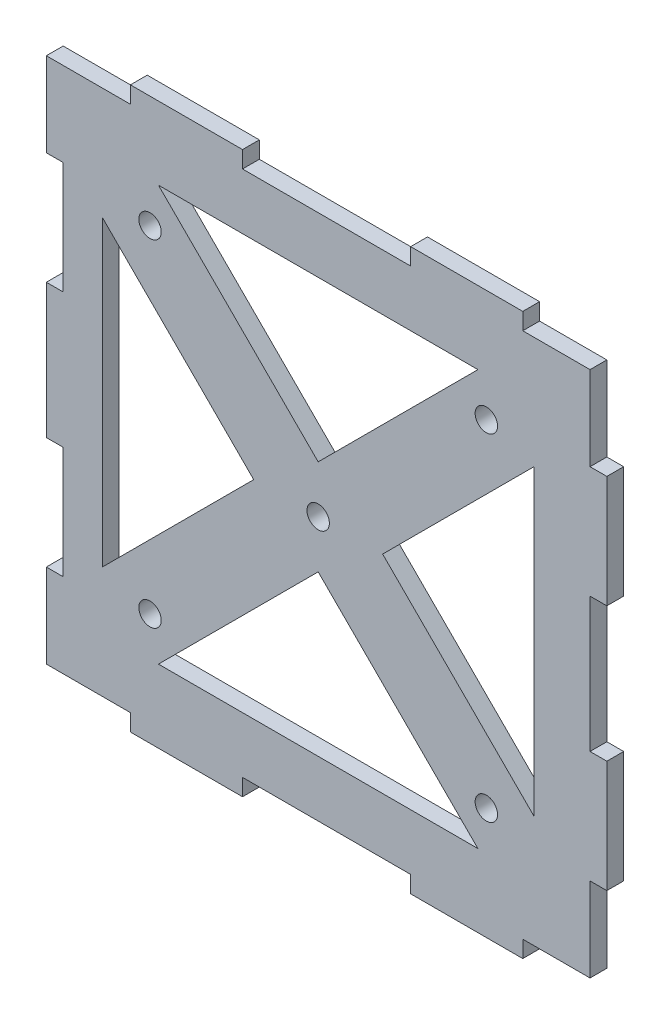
ISO-10303-21;
HEADER;
FILE_DESCRIPTION(('STEP AP214'),'2;1');
FILE_NAME('part.step','',(''),(''),'','','');
FILE_SCHEMA(('AUTOMOTIVE_DESIGN { 1 0 10303 214 1 1 1 1 }'));
ENDSEC;
DATA;
#1=APPLICATION_CONTEXT('core data for automotive mechanical design processes');
#2=APPLICATION_PROTOCOL_DEFINITION('international standard','automotive_design',2000,#1);
#3=PRODUCT_CONTEXT('',#1,'mechanical');
#4=PRODUCT('Part','Part','',(#3));
#5=PRODUCT_RELATED_PRODUCT_CATEGORY('part','',(#4));
#6=PRODUCT_DEFINITION_FORMATION('','',#4);
#7=PRODUCT_DEFINITION_CONTEXT('part definition',#1,'design');
#8=PRODUCT_DEFINITION('design','',#6,#7);
#9=PRODUCT_DEFINITION_SHAPE('','',#8);
#10=(LENGTH_UNIT() NAMED_UNIT(*) SI_UNIT(.MILLI.,.METRE.));
#11=(NAMED_UNIT(*) PLANE_ANGLE_UNIT() SI_UNIT($,.RADIAN.));
#12=(NAMED_UNIT(*) SI_UNIT($,.STERADIAN.) SOLID_ANGLE_UNIT());
#13=UNCERTAINTY_MEASURE_WITH_UNIT(LENGTH_MEASURE(1.E-05),#10,'distance_accuracy_value','');
#14=(GEOMETRIC_REPRESENTATION_CONTEXT(3) GLOBAL_UNCERTAINTY_ASSIGNED_CONTEXT((#13)) GLOBAL_UNIT_ASSIGNED_CONTEXT((#10,
#11,#12)) REPRESENTATION_CONTEXT('',''));
#15=CARTESIAN_POINT('',(0.,0.,0.));
#16=DIRECTION('',(0.,0.,1.));
#17=DIRECTION('',(1.,0.,0.));
#18=AXIS2_PLACEMENT_3D('',#15,#16,#17);
#19=CARTESIAN_POINT('',(0.,3.42745403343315,3.));
#20=DIRECTION('',(0.,1.,0.));
#21=DIRECTION('',(-1.,0.,0.));
#22=AXIS2_PLACEMENT_3D('',#19,#20,#21);
#23=PLANE('',#22);
#24=DIRECTION('',(0.,0.,-1.));
#25=VECTOR('',#24,1.);
#26=CARTESIAN_POINT('',(-19.8514433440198,3.42745403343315,3.));
#27=LINE('',#26,#25);
#28=CARTESIAN_POINT('',(-19.8514433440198,3.42745403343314,3.));
#29=VERTEX_POINT('',#28);
#30=CARTESIAN_POINT('',(-19.8514433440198,3.42745403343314,0.));
#31=VERTEX_POINT('',#30);
#32=EDGE_CURVE('E62',#29,#31,#27,.T.);
#33=ORIENTED_EDGE('',*,*,#32,.F.);
#34=DIRECTION('',(1.,0.,0.));
#35=VECTOR('',#34,1.);
#36=CARTESIAN_POINT('',(0.,3.42745403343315,3.));
#37=LINE('',#36,#35);
#38=CARTESIAN_POINT('',(-49.8514433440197,3.42745403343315,3.));
#39=VERTEX_POINT('',#38);
#40=EDGE_CURVE('E600',#39,#29,#37,.T.);
#41=ORIENTED_EDGE('',*,*,#40,.F.);
#42=DIRECTION('',(0.,0.,1.));
#43=VECTOR('',#42,1.);
#44=CARTESIAN_POINT('',(-49.8514433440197,3.42745403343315,3.));
#45=LINE('',#44,#43);
#46=CARTESIAN_POINT('',(-49.8514433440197,3.42745403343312,0.));
#47=VERTEX_POINT('',#46);
#48=EDGE_CURVE('E373',#47,#39,#45,.T.);
#49=ORIENTED_EDGE('',*,*,#48,.F.);
#50=DIRECTION('',(1.,0.,0.));
#51=VECTOR('',#50,1.);
#52=CARTESIAN_POINT('',(0.,3.42745403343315,0.));
#53=LINE('',#52,#51);
#54=EDGE_CURVE('E669',#47,#31,#53,.T.);
#55=ORIENTED_EDGE('',*,*,#54,.T.);
#56=EDGE_LOOP('',(#33,#41,#49,#55));
#57=FACE_BOUND('',#56,.T.);
#58=ADVANCED_FACE('F37',(#57),#23,.F.);
#59=DIRECTION('',(0.,0.,1.));
#60=VECTOR('',#59,1.);
#61=CARTESIAN_POINT('',(0.148556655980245,3.42745403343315,3.));
#62=LINE('',#61,#60);
#63=CARTESIAN_POINT('',(0.148556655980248,3.42745403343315,0.));
#64=VERTEX_POINT('',#63);
#65=CARTESIAN_POINT('',(0.148556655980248,3.42745403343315,3.));
#66=VERTEX_POINT('',#65);
#67=EDGE_CURVE('E367',#64,#66,#62,.T.);
#68=ORIENTED_EDGE('',*,*,#67,.F.);
#69=CARTESIAN_POINT('',(12.1485566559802,3.42745403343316,0.));
#70=VERTEX_POINT('',#69);
#71=EDGE_CURVE('E664',#64,#70,#53,.T.);
#72=ORIENTED_EDGE('',*,*,#71,.T.);
#73=DIRECTION('',(0.,0.,-1.));
#74=VECTOR('',#73,1.);
#75=CARTESIAN_POINT('',(12.1485566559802,3.42745403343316,3.));
#76=LINE('',#75,#74);
#77=CARTESIAN_POINT('',(12.1485566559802,3.42745403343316,3.));
#78=VERTEX_POINT('',#77);
#79=EDGE_CURVE('E683',#78,#70,#76,.T.);
#80=ORIENTED_EDGE('',*,*,#79,.F.);
#81=EDGE_CURVE('E54',#66,#78,#37,.T.);
#82=ORIENTED_EDGE('',*,*,#81,.F.);
#83=EDGE_LOOP('',(#68,#72,#80,#82));
#84=FACE_BOUND('',#83,.T.);
#85=ADVANCED_FACE('F741',(#84),#23,.F.);
#86=DIRECTION('',(0.,0.,-1.));
#87=VECTOR('',#86,1.);
#88=CARTESIAN_POINT('',(-69.8514433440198,3.42745403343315,3.));
#89=LINE('',#88,#87);
#90=CARTESIAN_POINT('',(-69.8514433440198,3.4274540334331,3.));
#91=VERTEX_POINT('',#90);
#92=CARTESIAN_POINT('',(-69.8514433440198,3.4274540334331,0.));
#93=VERTEX_POINT('',#92);
#94=EDGE_CURVE('E370',#91,#93,#89,.T.);
#95=ORIENTED_EDGE('',*,*,#94,.F.);
#96=CARTESIAN_POINT('',(-84.8514433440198,3.42745403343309,3.));
#97=VERTEX_POINT('',#96);
#98=EDGE_CURVE('E596',#97,#91,#37,.T.);
#99=ORIENTED_EDGE('',*,*,#98,.F.);
#100=DIRECTION('',(0.,0.,-1.));
#101=VECTOR('',#100,1.);
#102=CARTESIAN_POINT('',(-84.8514433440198,3.42745403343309,3.));
#103=LINE('',#102,#101);
#104=CARTESIAN_POINT('',(-84.8514433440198,3.42745403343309,0.));
#105=VERTEX_POINT('',#104);
#106=EDGE_CURVE('E686',#97,#105,#103,.T.);
#107=ORIENTED_EDGE('',*,*,#106,.T.);
#108=EDGE_CURVE('E666',#105,#93,#53,.T.);
#109=ORIENTED_EDGE('',*,*,#108,.T.);
#110=EDGE_LOOP('',(#95,#99,#107,#109));
#111=FACE_BOUND('',#110,.T.);
#112=ADVANCED_FACE('F743',(#111),#23,.F.);
#113=CARTESIAN_POINT('',(12.1485566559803,0.,3.));
#114=DIRECTION('',(1.,0.,0.));
#115=DIRECTION('',(0.,1.,0.));
#116=AXIS2_PLACEMENT_3D('',#113,#114,#115);
#117=PLANE('',#116);
#118=DIRECTION('',(0.,-1.,0.));
#119=VECTOR('',#118,1.);
#120=CARTESIAN_POINT('',(12.1485566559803,0.,0.));
#121=LINE('',#120,#119);
#122=CARTESIAN_POINT('',(12.1485566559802,18.4274540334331,0.));
#123=VERTEX_POINT('',#122);
#124=EDGE_CURVE('E650',#123,#70,#121,.T.);
#125=ORIENTED_EDGE('',*,*,#124,.F.);
#126=DIRECTION('',(0.,0.,-1.));
#127=VECTOR('',#126,1.);
#128=CARTESIAN_POINT('',(12.1485566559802,18.4274540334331,3.));
#129=LINE('',#128,#127);
#130=CARTESIAN_POINT('',(12.1485566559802,18.4274540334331,3.));
#131=VERTEX_POINT('',#130);
#132=EDGE_CURVE('E402',#131,#123,#129,.T.);
#133=ORIENTED_EDGE('',*,*,#132,.F.);
#134=DIRECTION('',(0.,-1.,0.));
#135=VECTOR('',#134,1.);
#136=CARTESIAN_POINT('',(12.1485566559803,0.,3.));
#137=LINE('',#136,#135);
#138=EDGE_CURVE('E583',#131,#78,#137,.T.);
#139=ORIENTED_EDGE('',*,*,#138,.T.);
#140=ORIENTED_EDGE('',*,*,#79,.T.);
#141=EDGE_LOOP('',(#125,#133,#139,#140));
#142=FACE_BOUND('',#141,.T.);
#143=ADVANCED_FACE('F750',(#142),#117,.T.);
#144=CARTESIAN_POINT('',(12.1485566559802,62.4274540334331,3.));
#145=VERTEX_POINT('',#144);
#146=CARTESIAN_POINT('',(12.1485566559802,38.4274540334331,3.));
#147=VERTEX_POINT('',#146);
#148=EDGE_CURVE('E587',#145,#147,#137,.T.);
#149=ORIENTED_EDGE('',*,*,#148,.T.);
#150=DIRECTION('',(0.,0.,1.));
#151=VECTOR('',#150,1.);
#152=CARTESIAN_POINT('',(12.1485566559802,38.4274540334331,3.));
#153=LINE('',#152,#151);
#154=CARTESIAN_POINT('',(12.1485566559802,38.4274540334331,0.));
#155=VERTEX_POINT('',#154);
#156=EDGE_CURVE('E407',#155,#147,#153,.T.);
#157=ORIENTED_EDGE('',*,*,#156,.F.);
#158=CARTESIAN_POINT('',(12.1485566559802,62.4274540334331,0.));
#159=VERTEX_POINT('',#158);
#160=EDGE_CURVE('E655',#159,#155,#121,.T.);
#161=ORIENTED_EDGE('',*,*,#160,.F.);
#162=DIRECTION('',(0.,0.,-1.));
#163=VECTOR('',#162,1.);
#164=CARTESIAN_POINT('',(12.1485566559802,62.4274540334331,3.));
#165=LINE('',#164,#163);
#166=EDGE_CURVE('E425',#145,#159,#165,.T.);
#167=ORIENTED_EDGE('',*,*,#166,.F.);
#168=EDGE_LOOP('',(#149,#157,#161,#167));
#169=FACE_BOUND('',#168,.T.);
#170=ADVANCED_FACE('F755',(#169),#117,.T.);
#171=DIRECTION('',(0.,0.,1.));
#172=VECTOR('',#171,1.);
#173=CARTESIAN_POINT('',(12.1485566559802,82.4274540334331,3.));
#174=LINE('',#173,#172);
#175=CARTESIAN_POINT('',(12.1485566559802,82.4274540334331,0.));
#176=VERTEX_POINT('',#175);
#177=CARTESIAN_POINT('',(12.1485566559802,82.4274540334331,3.));
#178=VERTEX_POINT('',#177);
#179=EDGE_CURVE('E430',#176,#178,#174,.T.);
#180=ORIENTED_EDGE('',*,*,#179,.F.);
#181=CARTESIAN_POINT('',(12.1485566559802,97.4274540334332,0.));
#182=VERTEX_POINT('',#181);
#183=EDGE_CURVE('E651',#182,#176,#121,.T.);
#184=ORIENTED_EDGE('',*,*,#183,.F.);
#185=DIRECTION('',(0.,0.,-1.));
#186=VECTOR('',#185,1.);
#187=CARTESIAN_POINT('',(12.1485566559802,97.4274540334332,3.));
#188=LINE('',#187,#186);
#189=CARTESIAN_POINT('',(12.1485566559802,97.4274540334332,3.));
#190=VERTEX_POINT('',#189);
#191=EDGE_CURVE('E11',#190,#182,#188,.T.);
#192=ORIENTED_EDGE('',*,*,#191,.F.);
#193=EDGE_CURVE('E584',#190,#178,#137,.T.);
#194=ORIENTED_EDGE('',*,*,#193,.T.);
#195=EDGE_LOOP('',(#180,#184,#192,#194));
#196=FACE_BOUND('',#195,.T.);
#197=ADVANCED_FACE('F758',(#196),#117,.T.);
#198=CARTESIAN_POINT('',(0.,97.4274540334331,3.));
#199=DIRECTION('',(0.,1.,0.));
#200=DIRECTION('',(-1.,0.,0.));
#201=AXIS2_PLACEMENT_3D('',#198,#199,#200);
#202=PLANE('',#201);
#203=DIRECTION('',(1.,0.,0.));
#204=VECTOR('',#203,1.);
#205=CARTESIAN_POINT('',(0.,97.4274540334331,3.));
#206=LINE('',#205,#204);
#207=CARTESIAN_POINT('',(-49.8514433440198,97.4274540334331,3.));
#208=VERTEX_POINT('',#207);
#209=CARTESIAN_POINT('',(-19.8514433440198,97.4274540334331,3.));
#210=VERTEX_POINT('',#209);
#211=EDGE_CURVE('E591',#208,#210,#206,.T.);
#212=ORIENTED_EDGE('',*,*,#211,.T.);
#213=DIRECTION('',(0.,0.,1.));
#214=VECTOR('',#213,1.);
#215=CARTESIAN_POINT('',(-19.8514433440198,97.4274540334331,0.));
#216=LINE('',#215,#214);
#217=CARTESIAN_POINT('',(-19.8514433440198,97.4274540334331,0.));
#218=VERTEX_POINT('',#217);
#219=EDGE_CURVE('E452',#218,#210,#216,.T.);
#220=ORIENTED_EDGE('',*,*,#219,.F.);
#221=DIRECTION('',(1.,0.,0.));
#222=VECTOR('',#221,1.);
#223=CARTESIAN_POINT('',(0.,97.4274540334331,0.));
#224=LINE('',#223,#222);
#225=CARTESIAN_POINT('',(-49.8514433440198,97.4274540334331,0.));
#226=VERTEX_POINT('',#225);
#227=EDGE_CURVE('E660',#226,#218,#224,.T.);
#228=ORIENTED_EDGE('',*,*,#227,.F.);
#229=DIRECTION('',(0.,0.,-1.));
#230=VECTOR('',#229,1.);
#231=CARTESIAN_POINT('',(-49.8514433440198,97.4274540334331,0.));
#232=LINE('',#231,#230);
#233=EDGE_CURVE('E480',#208,#226,#232,.T.);
#234=ORIENTED_EDGE('',*,*,#233,.F.);
#235=EDGE_LOOP('',(#212,#220,#228,#234));
#236=FACE_BOUND('',#235,.T.);
#237=ADVANCED_FACE('F822',(#236),#202,.T.);
#238=CARTESIAN_POINT('',(0.148556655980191,97.4274540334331,0.));
#239=VERTEX_POINT('',#238);
#240=EDGE_CURVE('E654',#239,#182,#224,.T.);
#241=ORIENTED_EDGE('',*,*,#240,.F.);
#242=DIRECTION('',(0.,0.,-1.));
#243=VECTOR('',#242,1.);
#244=CARTESIAN_POINT('',(0.148556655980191,97.4274540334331,0.));
#245=LINE('',#244,#243);
#246=CARTESIAN_POINT('',(0.148556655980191,97.4274540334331,3.));
#247=VERTEX_POINT('',#246);
#248=EDGE_CURVE('E457',#247,#239,#245,.T.);
#249=ORIENTED_EDGE('',*,*,#248,.F.);
#250=EDGE_CURVE('E586',#247,#190,#206,.T.);
#251=ORIENTED_EDGE('',*,*,#250,.T.);
#252=ORIENTED_EDGE('',*,*,#191,.T.);
#253=EDGE_LOOP('',(#241,#249,#251,#252));
#254=FACE_BOUND('',#253,.T.);
#255=ADVANCED_FACE('F816',(#254),#202,.T.);
#256=DIRECTION('',(0.,0.,1.));
#257=VECTOR('',#256,1.);
#258=CARTESIAN_POINT('',(-69.8514433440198,97.4274540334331,0.));
#259=LINE('',#258,#257);
#260=CARTESIAN_POINT('',(-69.8514433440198,97.4274540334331,0.));
#261=VERTEX_POINT('',#260);
#262=CARTESIAN_POINT('',(-69.8514433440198,97.4274540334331,3.));
#263=VERTEX_POINT('',#262);
#264=EDGE_CURVE('E475',#261,#263,#259,.T.);
#265=ORIENTED_EDGE('',*,*,#264,.F.);
#266=CARTESIAN_POINT('',(-84.8514433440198,97.4274540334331,0.));
#267=VERTEX_POINT('',#266);
#268=EDGE_CURVE('E656',#267,#261,#224,.T.);
#269=ORIENTED_EDGE('',*,*,#268,.F.);
#270=DIRECTION('',(0.,0.,-1.));
#271=VECTOR('',#270,1.);
#272=CARTESIAN_POINT('',(-84.8514433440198,97.4274540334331,3.));
#273=LINE('',#272,#271);
#274=CARTESIAN_POINT('',(-84.8514433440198,97.4274540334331,3.));
#275=VERTEX_POINT('',#274);
#276=EDGE_CURVE('E46',#275,#267,#273,.T.);
#277=ORIENTED_EDGE('',*,*,#276,.F.);
#278=EDGE_CURVE('E588',#275,#263,#206,.T.);
#279=ORIENTED_EDGE('',*,*,#278,.T.);
#280=EDGE_LOOP('',(#265,#269,#277,#279));
#281=FACE_BOUND('',#280,.T.);
#282=ADVANCED_FACE('F842',(#281),#202,.T.);
#283=CARTESIAN_POINT('',(-84.8514433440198,0.,3.));
#284=DIRECTION('',(1.,0.,0.));
#285=DIRECTION('',(0.,1.,0.));
#286=AXIS2_PLACEMENT_3D('',#283,#284,#285);
#287=PLANE('',#286);
#288=DIRECTION('',(0.,-1.,0.));
#289=VECTOR('',#288,1.);
#290=CARTESIAN_POINT('',(-84.8514433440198,0.,3.));
#291=LINE('',#290,#289);
#292=CARTESIAN_POINT('',(-84.8514433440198,18.4274540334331,3.));
#293=VERTEX_POINT('',#292);
#294=EDGE_CURVE('E590',#293,#97,#291,.T.);
#295=ORIENTED_EDGE('',*,*,#294,.F.);
#296=DIRECTION('',(0.,0.,1.));
#297=VECTOR('',#296,1.);
#298=CARTESIAN_POINT('',(-84.8514433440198,18.4274540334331,-0.00100000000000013));
#299=LINE('',#298,#297);
#300=CARTESIAN_POINT('',(-84.8514433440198,18.4274540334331,0.));
#301=VERTEX_POINT('',#300);
#302=EDGE_CURVE('E515',#301,#293,#299,.T.);
#303=ORIENTED_EDGE('',*,*,#302,.F.);
#304=DIRECTION('',(0.,-1.,0.));
#305=VECTOR('',#304,1.);
#306=CARTESIAN_POINT('',(-84.8514433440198,0.,0.));
#307=LINE('',#306,#305);
#308=EDGE_CURVE('E659',#301,#105,#307,.T.);
#309=ORIENTED_EDGE('',*,*,#308,.T.);
#310=ORIENTED_EDGE('',*,*,#106,.F.);
#311=EDGE_LOOP('',(#295,#303,#309,#310));
#312=FACE_BOUND('',#311,.T.);
#313=ADVANCED_FACE('F880',(#312),#287,.F.);
#314=CARTESIAN_POINT('',(-84.8514433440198,82.4274540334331,0.));
#315=VERTEX_POINT('',#314);
#316=EDGE_CURVE('E661',#267,#315,#307,.T.);
#317=ORIENTED_EDGE('',*,*,#316,.T.);
#318=DIRECTION('',(0.,0.,1.));
#319=VECTOR('',#318,1.);
#320=CARTESIAN_POINT('',(-84.8514433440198,82.4274540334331,-0.00100000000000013));
#321=LINE('',#320,#319);
#322=CARTESIAN_POINT('',(-84.8514433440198,82.4274540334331,3.));
#323=VERTEX_POINT('',#322);
#324=EDGE_CURVE('E540',#315,#323,#321,.T.);
#325=ORIENTED_EDGE('',*,*,#324,.T.);
#326=EDGE_CURVE('E592',#275,#323,#291,.T.);
#327=ORIENTED_EDGE('',*,*,#326,.F.);
#328=ORIENTED_EDGE('',*,*,#276,.T.);
#329=EDGE_LOOP('',(#317,#325,#327,#328));
#330=FACE_BOUND('',#329,.T.);
#331=ADVANCED_FACE('F847',(#330),#287,.F.);
#332=CARTESIAN_POINT('',(-84.8514433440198,62.4274540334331,0.));
#333=VERTEX_POINT('',#332);
#334=CARTESIAN_POINT('',(-84.8514433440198,38.4274540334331,0.));
#335=VERTEX_POINT('',#334);
#336=EDGE_CURVE('E665',#333,#335,#307,.T.);
#337=ORIENTED_EDGE('',*,*,#336,.T.);
#338=DIRECTION('',(0.,0.,1.));
#339=VECTOR('',#338,1.);
#340=CARTESIAN_POINT('',(-84.8514433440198,38.4274540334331,-0.00100000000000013));
#341=LINE('',#340,#339);
#342=CARTESIAN_POINT('',(-84.8514433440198,38.4274540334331,3.));
#343=VERTEX_POINT('',#342);
#344=EDGE_CURVE('E518',#335,#343,#341,.T.);
#345=ORIENTED_EDGE('',*,*,#344,.T.);
#346=CARTESIAN_POINT('',(-84.8514433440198,62.4274540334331,3.));
#347=VERTEX_POINT('',#346);
#348=EDGE_CURVE('E595',#347,#343,#291,.T.);
#349=ORIENTED_EDGE('',*,*,#348,.F.);
#350=DIRECTION('',(0.,0.,1.));
#351=VECTOR('',#350,1.);
#352=CARTESIAN_POINT('',(-84.8514433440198,62.4274540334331,-0.00100000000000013));
#353=LINE('',#352,#351);
#354=EDGE_CURVE('E539',#333,#347,#353,.T.);
#355=ORIENTED_EDGE('',*,*,#354,.F.);
#356=EDGE_LOOP('',(#337,#345,#349,#355));
#357=FACE_BOUND('',#356,.T.);
#358=ADVANCED_FACE('F866',(#357),#287,.F.);
#359=CARTESIAN_POINT('',(-74.8514433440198,0.,3.));
#360=DIRECTION('',(1.,0.,0.));
#361=DIRECTION('',(0.,1.,0.));
#362=AXIS2_PLACEMENT_3D('',#359,#360,#361);
#363=PLANE('',#362);
#364=DIRECTION('',(0.,-1.,0.));
#365=VECTOR('',#364,1.);
#366=CARTESIAN_POINT('',(-74.8514433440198,0.,0.));
#367=LINE('',#366,#365);
#368=CARTESIAN_POINT('',(-74.8514433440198,77.4274540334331,0.));
#369=VERTEX_POINT('',#368);
#370=CARTESIAN_POINT('',(-74.8514433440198,23.4274540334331,0.));
#371=VERTEX_POINT('',#370);
#372=EDGE_CURVE('E641',#369,#371,#367,.T.);
#373=ORIENTED_EDGE('',*,*,#372,.F.);
#374=DIRECTION('',(0.,0.,-1.));
#375=VECTOR('',#374,1.);
#376=CARTESIAN_POINT('',(-74.8514433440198,77.4274540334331,3.));
#377=LINE('',#376,#375);
#378=CARTESIAN_POINT('',(-74.8514433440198,77.4274540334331,3.));
#379=VERTEX_POINT('',#378);
#380=EDGE_CURVE('E687',#379,#369,#377,.T.);
#381=ORIENTED_EDGE('',*,*,#380,.F.);
#382=DIRECTION('',(0.,-1.,0.));
#383=VECTOR('',#382,1.);
#384=CARTESIAN_POINT('',(-74.8514433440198,0.,3.));
#385=LINE('',#384,#383);
#386=CARTESIAN_POINT('',(-74.8514433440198,23.4274540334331,3.));
#387=VERTEX_POINT('',#386);
#388=EDGE_CURVE('E575',#379,#387,#385,.T.);
#389=ORIENTED_EDGE('',*,*,#388,.T.);
#390=DIRECTION('',(0.,0.,-1.));
#391=VECTOR('',#390,1.);
#392=CARTESIAN_POINT('',(-74.8514433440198,23.4274540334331,3.));
#393=LINE('',#392,#391);
#394=EDGE_CURVE('E691',#387,#371,#393,.T.);
#395=ORIENTED_EDGE('',*,*,#394,.T.);
#396=EDGE_LOOP('',(#373,#381,#389,#395));
#397=FACE_BOUND('',#396,.T.);
#398=ADVANCED_FACE('F957',(#397),#363,.T.);
#399=CARTESIAN_POINT('',(1.28800534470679,1.2880053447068,3.));
#400=DIRECTION('',(0.707106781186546,0.707106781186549,0.));
#401=DIRECTION('',(-0.707106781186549,0.707106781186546,0.));
#402=AXIS2_PLACEMENT_3D('',#399,#400,#401);
#403=PLANE('',#402);
#404=DIRECTION('',(0.707106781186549,-0.707106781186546,0.));
#405=VECTOR('',#404,1.);
#406=CARTESIAN_POINT('',(1.28800534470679,1.2880053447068,0.));
#407=LINE('',#406,#405);
#408=CARTESIAN_POINT('',(-47.8514433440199,50.4274540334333,0.));
#409=VERTEX_POINT('',#408);
#410=EDGE_CURVE('E644',#369,#409,#407,.T.);
#411=ORIENTED_EDGE('',*,*,#410,.T.);
#412=DIRECTION('',(0.,0.,-1.));
#413=VECTOR('',#412,1.);
#414=CARTESIAN_POINT('',(-47.8514433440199,50.4274540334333,3.));
#415=LINE('',#414,#413);
#416=CARTESIAN_POINT('',(-47.8514433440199,50.4274540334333,3.));
#417=VERTEX_POINT('',#416);
#418=EDGE_CURVE('E693',#417,#409,#415,.T.);
#419=ORIENTED_EDGE('',*,*,#418,.F.);
#420=DIRECTION('',(0.707106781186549,-0.707106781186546,0.));
#421=VECTOR('',#420,1.);
#422=CARTESIAN_POINT('',(1.28800534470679,1.2880053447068,3.));
#423=LINE('',#422,#421);
#424=EDGE_CURVE('E578',#379,#417,#423,.T.);
#425=ORIENTED_EDGE('',*,*,#424,.F.);
#426=ORIENTED_EDGE('',*,*,#380,.T.);
#427=EDGE_LOOP('',(#411,#419,#425,#426));
#428=FACE_BOUND('',#427,.T.);
#429=ADVANCED_FACE('F953',(#428),#403,.F.);
#430=CARTESIAN_POINT('',(0.,13.4274540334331,3.));
#431=DIRECTION('',(0.,1.,0.));
#432=DIRECTION('',(0.,0.,1.));
#433=AXIS2_PLACEMENT_3D('',#430,#431,#432);
#434=PLANE('',#433);
#435=DIRECTION('',(1.,0.,0.));
#436=VECTOR('',#435,1.);
#437=CARTESIAN_POINT('',(0.,13.4274540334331,0.));
#438=LINE('',#437,#436);
#439=CARTESIAN_POINT('',(-64.8514433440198,13.4274540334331,0.));
#440=VERTEX_POINT('',#439);
#441=CARTESIAN_POINT('',(-7.8514433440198,13.4274540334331,0.));
#442=VERTEX_POINT('',#441);
#443=EDGE_CURVE('E632',#440,#442,#438,.T.);
#444=ORIENTED_EDGE('',*,*,#443,.F.);
#445=DIRECTION('',(0.,0.,-1.));
#446=VECTOR('',#445,1.);
#447=CARTESIAN_POINT('',(-64.8514433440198,13.4274540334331,3.));
#448=LINE('',#447,#446);
#449=CARTESIAN_POINT('',(-64.8514433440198,13.4274540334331,3.));
#450=VERTEX_POINT('',#449);
#451=EDGE_CURVE('E694',#450,#440,#448,.T.);
#452=ORIENTED_EDGE('',*,*,#451,.F.);
#453=DIRECTION('',(1.,0.,0.));
#454=VECTOR('',#453,1.);
#455=CARTESIAN_POINT('',(0.,13.4274540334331,3.));
#456=LINE('',#455,#454);
#457=CARTESIAN_POINT('',(-7.8514433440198,13.4274540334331,3.));
#458=VERTEX_POINT('',#457);
#459=EDGE_CURVE('E567',#450,#458,#456,.T.);
#460=ORIENTED_EDGE('',*,*,#459,.T.);
#461=DIRECTION('',(0.,0.,-1.));
#462=VECTOR('',#461,1.);
#463=CARTESIAN_POINT('',(-7.8514433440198,13.4274540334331,3.));
#464=LINE('',#463,#462);
#465=EDGE_CURVE('E697',#458,#442,#464,.T.);
#466=ORIENTED_EDGE('',*,*,#465,.T.);
#467=EDGE_LOOP('',(#444,#452,#460,#466));
#468=FACE_BOUND('',#467,.T.);
#469=ADVANCED_FACE('F956',(#468),#434,.T.);
#470=CARTESIAN_POINT('',(-39.1394486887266,39.1394486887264,3.));
#471=DIRECTION('',(-0.707106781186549,0.707106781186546,0.));
#472=DIRECTION('',(-0.707106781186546,-0.707106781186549,0.));
#473=AXIS2_PLACEMENT_3D('',#470,#471,#472);
#474=PLANE('',#473);
#475=DIRECTION('',(0.707106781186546,0.707106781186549,0.));
#476=VECTOR('',#475,1.);
#477=CARTESIAN_POINT('',(-39.1394486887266,39.1394486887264,0.));
#478=LINE('',#477,#476);
#479=CARTESIAN_POINT('',(-36.3514433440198,41.9274540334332,0.));
#480=VERTEX_POINT('',#479);
#481=EDGE_CURVE('E635',#440,#480,#478,.T.);
#482=ORIENTED_EDGE('',*,*,#481,.T.);
#483=DIRECTION('',(0.,0.,-1.));
#484=VECTOR('',#483,1.);
#485=CARTESIAN_POINT('',(-36.3514433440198,41.9274540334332,3.));
#486=LINE('',#485,#484);
#487=CARTESIAN_POINT('',(-36.3514433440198,41.9274540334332,3.));
#488=VERTEX_POINT('',#487);
#489=EDGE_CURVE('E699',#488,#480,#486,.T.);
#490=ORIENTED_EDGE('',*,*,#489,.F.);
#491=DIRECTION('',(0.707106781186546,0.707106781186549,0.));
#492=VECTOR('',#491,1.);
#493=CARTESIAN_POINT('',(-39.1394486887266,39.1394486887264,3.));
#494=LINE('',#493,#492);
#495=EDGE_CURVE('E570',#450,#488,#494,.T.);
#496=ORIENTED_EDGE('',*,*,#495,.F.);
#497=ORIENTED_EDGE('',*,*,#451,.T.);
#498=EDGE_LOOP('',(#482,#490,#496,#497));
#499=FACE_BOUND('',#498,.T.);
#500=ADVANCED_FACE('F962',(#499),#474,.F.);
#501=CARTESIAN_POINT('',(-37.6394486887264,37.6394486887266,3.));
#502=DIRECTION('',(0.707106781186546,-0.707106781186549,0.));
#503=DIRECTION('',(0.707106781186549,0.707106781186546,0.));
#504=AXIS2_PLACEMENT_3D('',#501,#502,#503);
#505=PLANE('',#504);
#506=DIRECTION('',(-0.707106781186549,-0.707106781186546,0.));
#507=VECTOR('',#506,1.);
#508=CARTESIAN_POINT('',(-37.6394486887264,37.6394486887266,0.));
#509=LINE('',#508,#507);
#510=CARTESIAN_POINT('',(2.14855665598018,77.4274540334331,0.));
#511=VERTEX_POINT('',#510);
#512=CARTESIAN_POINT('',(-24.8514433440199,50.4274540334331,0.));
#513=VERTEX_POINT('',#512);
#514=EDGE_CURVE('E623',#511,#513,#509,.T.);
#515=ORIENTED_EDGE('',*,*,#514,.F.);
#516=DIRECTION('',(0.,0.,-1.));
#517=VECTOR('',#516,1.);
#518=CARTESIAN_POINT('',(2.14855665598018,77.4274540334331,3.));
#519=LINE('',#518,#517);
#520=CARTESIAN_POINT('',(2.14855665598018,77.4274540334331,3.));
#521=VERTEX_POINT('',#520);
#522=EDGE_CURVE('E700',#521,#511,#519,.T.);
#523=ORIENTED_EDGE('',*,*,#522,.F.);
#524=DIRECTION('',(-0.707106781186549,-0.707106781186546,0.));
#525=VECTOR('',#524,1.);
#526=CARTESIAN_POINT('',(-37.6394486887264,37.6394486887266,3.));
#527=LINE('',#526,#525);
#528=CARTESIAN_POINT('',(-24.8514433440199,50.4274540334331,3.));
#529=VERTEX_POINT('',#528);
#530=EDGE_CURVE('E559',#521,#529,#527,.T.);
#531=ORIENTED_EDGE('',*,*,#530,.T.);
#532=DIRECTION('',(0.,0.,-1.));
#533=VECTOR('',#532,1.);
#534=CARTESIAN_POINT('',(-24.8514433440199,50.4274540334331,3.));
#535=LINE('',#534,#533);
#536=EDGE_CURVE('E704',#529,#513,#535,.T.);
#537=ORIENTED_EDGE('',*,*,#536,.T.);
#538=EDGE_LOOP('',(#515,#523,#531,#537));
#539=FACE_BOUND('',#538,.T.);
#540=ADVANCED_FACE('F965',(#539),#505,.T.);
#541=CARTESIAN_POINT('',(2.1485566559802,0.,3.));
#542=DIRECTION('',(1.,0.,0.));
#543=DIRECTION('',(0.,1.,0.));
#544=AXIS2_PLACEMENT_3D('',#541,#542,#543);
#545=PLANE('',#544);
#546=DIRECTION('',(0.,-1.,0.));
#547=VECTOR('',#546,1.);
#548=CARTESIAN_POINT('',(2.1485566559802,0.,0.));
#549=LINE('',#548,#547);
#550=CARTESIAN_POINT('',(2.14855665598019,23.4274540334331,0.));
#551=VERTEX_POINT('',#550);
#552=EDGE_CURVE('E626',#511,#551,#549,.T.);
#553=ORIENTED_EDGE('',*,*,#552,.T.);
#554=DIRECTION('',(0.,0.,-1.));
#555=VECTOR('',#554,1.);
#556=CARTESIAN_POINT('',(2.14855665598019,23.4274540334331,3.));
#557=LINE('',#556,#555);
#558=CARTESIAN_POINT('',(2.14855665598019,23.4274540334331,3.));
#559=VERTEX_POINT('',#558);
#560=EDGE_CURVE('E706',#559,#551,#557,.T.);
#561=ORIENTED_EDGE('',*,*,#560,.F.);
#562=DIRECTION('',(0.,-1.,0.));
#563=VECTOR('',#562,1.);
#564=CARTESIAN_POINT('',(2.1485566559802,0.,3.));
#565=LINE('',#564,#563);
#566=EDGE_CURVE('E562',#521,#559,#565,.T.);
#567=ORIENTED_EDGE('',*,*,#566,.F.);
#568=ORIENTED_EDGE('',*,*,#522,.T.);
#569=EDGE_LOOP('',(#553,#561,#567,#568));
#570=FACE_BOUND('',#569,.T.);
#571=ADVANCED_FACE('F970',(#570),#545,.F.);
#572=CARTESIAN_POINT('',(11.2880053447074,11.2880053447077,3.));
#573=DIRECTION('',(0.707106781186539,0.707106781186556,0.));
#574=DIRECTION('',(-0.707106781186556,0.707106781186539,0.));
#575=AXIS2_PLACEMENT_3D('',#572,#573,#574);
#576=PLANE('',#575);
#577=DIRECTION('',(0.707106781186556,-0.707106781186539,0.));
#578=VECTOR('',#577,1.);
#579=CARTESIAN_POINT('',(11.2880053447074,11.2880053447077,0.));
#580=LINE('',#579,#578);
#581=CARTESIAN_POINT('',(-64.8514433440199,87.4274540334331,0.));
#582=VERTEX_POINT('',#581);
#583=CARTESIAN_POINT('',(-36.3514433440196,58.9274540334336,0.));
#584=VERTEX_POINT('',#583);
#585=EDGE_CURVE('E550',#582,#584,#580,.T.);
#586=ORIENTED_EDGE('',*,*,#585,.F.);
#587=DIRECTION('',(0.,0.,-1.));
#588=VECTOR('',#587,1.);
#589=CARTESIAN_POINT('',(-64.8514433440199,87.4274540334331,3.));
#590=LINE('',#589,#588);
#591=CARTESIAN_POINT('',(-64.8514433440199,87.4274540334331,3.));
#592=VERTEX_POINT('',#591);
#593=EDGE_CURVE('E41',#592,#582,#590,.T.);
#594=ORIENTED_EDGE('',*,*,#593,.F.);
#595=DIRECTION('',(0.707106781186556,-0.707106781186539,0.));
#596=VECTOR('',#595,1.);
#597=CARTESIAN_POINT('',(11.2880053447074,11.2880053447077,3.));
#598=LINE('',#597,#596);
#599=CARTESIAN_POINT('',(-36.3514433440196,58.9274540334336,3.));
#600=VERTEX_POINT('',#599);
#601=EDGE_CURVE('E551',#592,#600,#598,.T.);
#602=ORIENTED_EDGE('',*,*,#601,.T.);
#603=DIRECTION('',(0.,0.,-1.));
#604=VECTOR('',#603,1.);
#605=CARTESIAN_POINT('',(-36.3514433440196,58.9274540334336,3.));
#606=LINE('',#605,#604);
#607=EDGE_CURVE('E615',#600,#584,#606,.T.);
#608=ORIENTED_EDGE('',*,*,#607,.T.);
#609=EDGE_LOOP('',(#586,#594,#602,#608));
#610=FACE_BOUND('',#609,.T.);
#611=ADVANCED_FACE('F39',(#610),#576,.T.);
#612=CARTESIAN_POINT('',(0.,87.4274540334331,3.));
#613=DIRECTION('',(0.,1.,0.));
#614=DIRECTION('',(0.,0.,1.));
#615=AXIS2_PLACEMENT_3D('',#612,#613,#614);
#616=PLANE('',#615);
#617=DIRECTION('',(1.,0.,0.));
#618=VECTOR('',#617,1.);
#619=CARTESIAN_POINT('',(0.,87.4274540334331,0.));
#620=LINE('',#619,#618);
#621=CARTESIAN_POINT('',(-7.85144334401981,87.4274540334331,0.));
#622=VERTEX_POINT('',#621);
#623=EDGE_CURVE('E618',#582,#622,#620,.T.);
#624=ORIENTED_EDGE('',*,*,#623,.T.);
#625=DIRECTION('',(0.,0.,-1.));
#626=VECTOR('',#625,1.);
#627=CARTESIAN_POINT('',(-7.85144334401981,87.4274540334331,3.));
#628=LINE('',#627,#626);
#629=CARTESIAN_POINT('',(-7.85144334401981,87.4274540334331,3.));
#630=VERTEX_POINT('',#629);
#631=EDGE_CURVE('E709',#630,#622,#628,.T.);
#632=ORIENTED_EDGE('',*,*,#631,.F.);
#633=DIRECTION('',(1.,0.,0.));
#634=VECTOR('',#633,1.);
#635=CARTESIAN_POINT('',(0.,87.4274540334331,3.));
#636=LINE('',#635,#634);
#637=EDGE_CURVE('E554',#592,#630,#636,.T.);
#638=ORIENTED_EDGE('',*,*,#637,.F.);
#639=ORIENTED_EDGE('',*,*,#593,.T.);
#640=EDGE_LOOP('',(#624,#632,#638,#639));
#641=FACE_BOUND('',#640,.T.);
#642=ADVANCED_FACE('F718',(#641),#616,.F.);
#643=CARTESIAN_POINT('',(-66.3514433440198,80.4274540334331,3.));
#644=DIRECTION('',(0.,0.,-1.));
#645=DIRECTION('',(-1.,0.,0.));
#646=AXIS2_PLACEMENT_3D('',#643,#644,#645);
#647=CYLINDRICAL_SURFACE('',#646,2.);
#648=CARTESIAN_POINT('',(-66.3514433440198,80.4274540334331,3.));
#649=DIRECTION('',(0.,0.,1.));
#650=DIRECTION('',(1.,0.,0.));
#651=AXIS2_PLACEMENT_3D('',#648,#649,#650);
#652=CIRCLE('',#651,2.);
#653=CARTESIAN_POINT('',(-64.3514433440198,80.4274540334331,3.));
#654=VERTEX_POINT('',#653);
#655=EDGE_CURVE('E609',#654,#654,#652,.T.);
#656=ORIENTED_EDGE('',*,*,#655,.T.);
#657=EDGE_LOOP('',(#656));
#658=FACE_BOUND('',#657,.T.);
#659=CARTESIAN_POINT('',(-66.3514433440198,80.4274540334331,0.));
#660=DIRECTION('',(0.,0.,1.));
#661=DIRECTION('',(1.,0.,0.));
#662=AXIS2_PLACEMENT_3D('',#659,#660,#661);
#663=CIRCLE('',#662,2.);
#664=CARTESIAN_POINT('',(-64.3514433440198,80.4274540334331,0.));
#665=VERTEX_POINT('',#664);
#666=EDGE_CURVE('E678',#665,#665,#663,.T.);
#667=ORIENTED_EDGE('',*,*,#666,.F.);
#668=EDGE_LOOP('',(#667));
#669=FACE_BOUND('',#668,.T.);
#670=ADVANCED_FACE('F900',(#658,#669),#647,.F.);
#671=CARTESIAN_POINT('',(-6.35144334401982,80.4274540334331,3.));
#672=DIRECTION('',(0.,0.,-1.));
#673=DIRECTION('',(-1.,0.,0.));
#674=AXIS2_PLACEMENT_3D('',#671,#672,#673);
#675=CYLINDRICAL_SURFACE('',#674,2.);
#676=CARTESIAN_POINT('',(-6.35144334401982,80.4274540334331,3.));
#677=DIRECTION('',(0.,0.,1.));
#678=DIRECTION('',(1.,0.,0.));
#679=AXIS2_PLACEMENT_3D('',#676,#677,#678);
#680=CIRCLE('',#679,2.);
#681=CARTESIAN_POINT('',(-4.35144334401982,80.4274540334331,3.));
#682=VERTEX_POINT('',#681);
#683=EDGE_CURVE('E606',#682,#682,#680,.T.);
#684=ORIENTED_EDGE('',*,*,#683,.T.);
#685=EDGE_LOOP('',(#684));
#686=FACE_BOUND('',#685,.T.);
#687=CARTESIAN_POINT('',(-6.35144334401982,80.4274540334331,0.));
#688=DIRECTION('',(0.,0.,1.));
#689=DIRECTION('',(1.,0.,0.));
#690=AXIS2_PLACEMENT_3D('',#687,#688,#689);
#691=CIRCLE('',#690,2.);
#692=CARTESIAN_POINT('',(-4.35144334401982,80.4274540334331,0.));
#693=VERTEX_POINT('',#692);
#694=EDGE_CURVE('E675',#693,#693,#691,.T.);
#695=ORIENTED_EDGE('',*,*,#694,.F.);
#696=EDGE_LOOP('',(#695));
#697=FACE_BOUND('',#696,.T.);
#698=ADVANCED_FACE('F903',(#686,#697),#675,.F.);
#699=CARTESIAN_POINT('',(-6.3514433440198,20.4274540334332,3.));
#700=DIRECTION('',(0.,0.,-1.));
#701=DIRECTION('',(-1.,0.,0.));
#702=AXIS2_PLACEMENT_3D('',#699,#700,#701);
#703=CYLINDRICAL_SURFACE('',#702,2.);
#704=CARTESIAN_POINT('',(-6.3514433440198,20.4274540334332,3.));
#705=DIRECTION('',(0.,0.,1.));
#706=DIRECTION('',(1.,0.,0.));
#707=AXIS2_PLACEMENT_3D('',#704,#705,#706);
#708=CIRCLE('',#707,2.);
#709=CARTESIAN_POINT('',(-4.3514433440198,20.4274540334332,3.));
#710=VERTEX_POINT('',#709);
#711=EDGE_CURVE('E603',#710,#710,#708,.T.);
#712=ORIENTED_EDGE('',*,*,#711,.T.);
#713=EDGE_LOOP('',(#712));
#714=FACE_BOUND('',#713,.T.);
#715=CARTESIAN_POINT('',(-6.3514433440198,20.4274540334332,0.));
#716=DIRECTION('',(0.,0.,1.));
#717=DIRECTION('',(1.,0.,0.));
#718=AXIS2_PLACEMENT_3D('',#715,#716,#717);
#719=CIRCLE('',#718,2.);
#720=CARTESIAN_POINT('',(-4.3514433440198,20.4274540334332,0.));
#721=VERTEX_POINT('',#720);
#722=EDGE_CURVE('E672',#721,#721,#719,.T.);
#723=ORIENTED_EDGE('',*,*,#722,.F.);
#724=EDGE_LOOP('',(#723));
#725=FACE_BOUND('',#724,.T.);
#726=ADVANCED_FACE('F907',(#714,#725),#703,.F.);
#727=CARTESIAN_POINT('',(-66.3514433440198,20.4274540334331,3.));
#728=DIRECTION('',(0.,0.,-1.));
#729=DIRECTION('',(-1.,0.,0.));
#730=AXIS2_PLACEMENT_3D('',#727,#728,#729);
#731=CYLINDRICAL_SURFACE('',#730,2.);
#732=CARTESIAN_POINT('',(-66.3514433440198,20.4274540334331,3.));
#733=DIRECTION('',(0.,0.,1.));
#734=DIRECTION('',(1.,0.,0.));
#735=AXIS2_PLACEMENT_3D('',#732,#733,#734);
#736=CIRCLE('',#735,2.);
#737=CARTESIAN_POINT('',(-64.3514433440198,20.4274540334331,3.));
#738=VERTEX_POINT('',#737);
#739=EDGE_CURVE('E599',#738,#738,#736,.T.);
#740=ORIENTED_EDGE('',*,*,#739,.T.);
#741=EDGE_LOOP('',(#740));
#742=FACE_BOUND('',#741,.T.);
#743=CARTESIAN_POINT('',(-66.3514433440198,20.4274540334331,0.));
#744=DIRECTION('',(0.,0.,1.));
#745=DIRECTION('',(1.,0.,0.));
#746=AXIS2_PLACEMENT_3D('',#743,#744,#745);
#747=CIRCLE('',#746,2.);
#748=CARTESIAN_POINT('',(-64.3514433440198,20.4274540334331,0.));
#749=VERTEX_POINT('',#748);
#750=EDGE_CURVE('E668',#749,#749,#747,.T.);
#751=ORIENTED_EDGE('',*,*,#750,.F.);
#752=EDGE_LOOP('',(#751));
#753=FACE_BOUND('',#752,.T.);
#754=ADVANCED_FACE('F910',(#742,#753),#731,.F.);
#755=CARTESIAN_POINT('',(-49.1394486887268,49.1394486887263,3.));
#756=DIRECTION('',(-0.707106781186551,0.707106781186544,0.));
#757=DIRECTION('',(-0.707106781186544,-0.707106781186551,0.));
#758=AXIS2_PLACEMENT_3D('',#755,#756,#757);
#759=PLANE('',#758);
#760=DIRECTION('',(0.707106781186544,0.707106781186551,0.));
#761=VECTOR('',#760,1.);
#762=CARTESIAN_POINT('',(-49.1394486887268,49.1394486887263,0.));
#763=LINE('',#762,#761);
#764=EDGE_CURVE('E647',#371,#409,#763,.T.);
#765=ORIENTED_EDGE('',*,*,#764,.F.);
#766=ORIENTED_EDGE('',*,*,#394,.F.);
#767=DIRECTION('',(0.707106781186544,0.707106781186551,0.));
#768=VECTOR('',#767,1.);
#769=CARTESIAN_POINT('',(-49.1394486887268,49.1394486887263,3.));
#770=LINE('',#769,#768);
#771=EDGE_CURVE('E580',#387,#417,#770,.T.);
#772=ORIENTED_EDGE('',*,*,#771,.T.);
#773=ORIENTED_EDGE('',*,*,#418,.T.);
#774=EDGE_LOOP('',(#765,#766,#772,#773));
#775=FACE_BOUND('',#774,.T.);
#776=ADVANCED_FACE('F913',(#775),#759,.T.);
#777=CARTESIAN_POINT('',(2.78800534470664,2.78800534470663,3.));
#778=DIRECTION('',(0.707106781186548,0.707106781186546,0.));
#779=DIRECTION('',(-0.707106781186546,0.707106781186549,0.));
#780=AXIS2_PLACEMENT_3D('',#777,#778,#779);
#781=PLANE('',#780);
#782=DIRECTION('',(0.707106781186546,-0.707106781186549,0.));
#783=VECTOR('',#782,1.);
#784=CARTESIAN_POINT('',(2.78800534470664,2.78800534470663,0.));
#785=LINE('',#784,#783);
#786=EDGE_CURVE('E638',#480,#442,#785,.T.);
#787=ORIENTED_EDGE('',*,*,#786,.T.);
#788=ORIENTED_EDGE('',*,*,#465,.F.);
#789=DIRECTION('',(0.707106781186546,-0.707106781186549,0.));
#790=VECTOR('',#789,1.);
#791=CARTESIAN_POINT('',(2.78800534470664,2.78800534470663,3.));
#792=LINE('',#791,#790);
#793=EDGE_CURVE('E573',#488,#458,#792,.T.);
#794=ORIENTED_EDGE('',*,*,#793,.F.);
#795=ORIENTED_EDGE('',*,*,#489,.T.);
#796=EDGE_LOOP('',(#787,#788,#794,#795));
#797=FACE_BOUND('',#796,.T.);
#798=ADVANCED_FACE('F736',(#797),#781,.F.);
#799=CARTESIAN_POINT('',(12.7880053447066,12.7880053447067,3.));
#800=DIRECTION('',(0.707106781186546,0.707106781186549,0.));
#801=DIRECTION('',(-0.707106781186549,0.707106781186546,0.));
#802=AXIS2_PLACEMENT_3D('',#799,#800,#801);
#803=PLANE('',#802);
#804=DIRECTION('',(0.707106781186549,-0.707106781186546,0.));
#805=VECTOR('',#804,1.);
#806=CARTESIAN_POINT('',(12.7880053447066,12.7880053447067,0.));
#807=LINE('',#806,#805);
#808=EDGE_CURVE('E629',#513,#551,#807,.T.);
#809=ORIENTED_EDGE('',*,*,#808,.F.);
#810=ORIENTED_EDGE('',*,*,#536,.F.);
#811=DIRECTION('',(0.707106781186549,-0.707106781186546,0.));
#812=VECTOR('',#811,1.);
#813=CARTESIAN_POINT('',(12.7880053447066,12.7880053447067,3.));
#814=LINE('',#813,#812);
#815=EDGE_CURVE('E564',#529,#559,#814,.T.);
#816=ORIENTED_EDGE('',*,*,#815,.T.);
#817=ORIENTED_EDGE('',*,*,#560,.T.);
#818=EDGE_LOOP('',(#809,#810,#816,#817));
#819=FACE_BOUND('',#818,.T.);
#820=ADVANCED_FACE('F727',(#819),#803,.T.);
#821=CARTESIAN_POINT('',(-47.6394486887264,47.6394486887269,3.));
#822=DIRECTION('',(0.707106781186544,-0.707106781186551,0.));
#823=DIRECTION('',(0.707106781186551,0.707106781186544,0.));
#824=AXIS2_PLACEMENT_3D('',#821,#822,#823);
#825=PLANE('',#824);
#826=DIRECTION('',(-0.707106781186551,-0.707106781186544,0.));
#827=VECTOR('',#826,1.);
#828=CARTESIAN_POINT('',(-47.6394486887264,47.6394486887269,0.));
#829=LINE('',#828,#827);
#830=EDGE_CURVE('E620',#622,#584,#829,.T.);
#831=ORIENTED_EDGE('',*,*,#830,.T.);
#832=ORIENTED_EDGE('',*,*,#607,.F.);
#833=DIRECTION('',(-0.707106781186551,-0.707106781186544,0.));
#834=VECTOR('',#833,1.);
#835=CARTESIAN_POINT('',(-47.6394486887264,47.6394486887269,3.));
#836=LINE('',#835,#834);
#837=EDGE_CURVE('E557',#630,#600,#836,.T.);
#838=ORIENTED_EDGE('',*,*,#837,.F.);
#839=ORIENTED_EDGE('',*,*,#631,.T.);
#840=EDGE_LOOP('',(#831,#832,#838,#839));
#841=FACE_BOUND('',#840,.T.);
#842=ADVANCED_FACE('F724',(#841),#825,.F.);
#843=CARTESIAN_POINT('',(-36.3514433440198,50.4274540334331,3.));
#844=DIRECTION('',(0.,0.,-1.));
#845=DIRECTION('',(-1.,0.,0.));
#846=AXIS2_PLACEMENT_3D('',#843,#844,#845);
#847=CYLINDRICAL_SURFACE('',#846,2.);
#848=CARTESIAN_POINT('',(-36.3514433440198,50.4274540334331,3.));
#849=DIRECTION('',(0.,0.,1.));
#850=DIRECTION('',(1.,0.,0.));
#851=AXIS2_PLACEMENT_3D('',#848,#849,#850);
#852=CIRCLE('',#851,2.);
#853=CARTESIAN_POINT('',(-34.3514433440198,50.4274540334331,3.));
#854=VERTEX_POINT('',#853);
#855=EDGE_CURVE('E612',#854,#854,#852,.T.);
#856=ORIENTED_EDGE('',*,*,#855,.T.);
#857=EDGE_LOOP('',(#856));
#858=FACE_BOUND('',#857,.T.);
#859=CARTESIAN_POINT('',(-36.3514433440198,50.4274540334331,0.));
#860=DIRECTION('',(0.,0.,1.));
#861=DIRECTION('',(1.,0.,0.));
#862=AXIS2_PLACEMENT_3D('',#859,#860,#861);
#863=CIRCLE('',#862,2.);
#864=CARTESIAN_POINT('',(-34.3514433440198,50.4274540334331,0.));
#865=VERTEX_POINT('',#864);
#866=EDGE_CURVE('E555',#865,#865,#863,.T.);
#867=ORIENTED_EDGE('',*,*,#866,.F.);
#868=EDGE_LOOP('',(#867));
#869=FACE_BOUND('',#868,.T.);
#870=ADVANCED_FACE('F726',(#858,#869),#847,.F.);
#871=CARTESIAN_POINT('',(0.,0.,3.));
#872=DIRECTION('',(0.,0.,1.));
#873=DIRECTION('',(1.,0.,0.));
#874=AXIS2_PLACEMENT_3D('',#871,#872,#873);
#875=PLANE('',#874);
#876=DIRECTION('',(1.,0.,0.));
#877=VECTOR('',#876,1.);
#878=CARTESIAN_POINT('',(-84.8514433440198,18.4274540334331,3.));
#879=LINE('',#878,#877);
#880=CARTESIAN_POINT('',(-81.8514433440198,18.4274540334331,3.));
#881=VERTEX_POINT('',#880);
#882=EDGE_CURVE('E506',#293,#881,#879,.T.);
#883=ORIENTED_EDGE('',*,*,#882,.F.);
#884=ORIENTED_EDGE('',*,*,#294,.T.);
#885=ORIENTED_EDGE('',*,*,#98,.T.);
#886=DIRECTION('',(0.,1.,0.));
#887=VECTOR('',#886,1.);
#888=CARTESIAN_POINT('',(-69.8514433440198,0.427454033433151,3.));
#889=LINE('',#888,#887);
#890=CARTESIAN_POINT('',(-69.8514433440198,0.427454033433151,3.));
#891=VERTEX_POINT('',#890);
#892=EDGE_CURVE('E387',#891,#91,#889,.T.);
#893=ORIENTED_EDGE('',*,*,#892,.F.);
#894=DIRECTION('',(-1.,0.,0.));
#895=VECTOR('',#894,1.);
#896=CARTESIAN_POINT('',(-69.8514433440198,0.427454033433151,3.));
#897=LINE('',#896,#895);
#898=CARTESIAN_POINT('',(-49.8514433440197,0.427454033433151,3.));
#899=VERTEX_POINT('',#898);
#900=EDGE_CURVE('E386',#899,#891,#897,.T.);
#901=ORIENTED_EDGE('',*,*,#900,.F.);
#902=DIRECTION('',(0.,1.,0.));
#903=VECTOR('',#902,1.);
#904=CARTESIAN_POINT('',(-49.8514433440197,0.427454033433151,3.));
#905=LINE('',#904,#903);
#906=EDGE_CURVE('E393',#899,#39,#905,.T.);
#907=ORIENTED_EDGE('',*,*,#906,.T.);
#908=ORIENTED_EDGE('',*,*,#40,.T.);
#909=DIRECTION('',(0.,1.,0.));
#910=VECTOR('',#909,1.);
#911=CARTESIAN_POINT('',(-19.8514433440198,0.427454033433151,3.));
#912=LINE('',#911,#910);
#913=CARTESIAN_POINT('',(-19.8514433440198,0.427454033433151,3.));
#914=VERTEX_POINT('',#913);
#915=EDGE_CURVE('E1356',#914,#29,#912,.T.);
#916=ORIENTED_EDGE('',*,*,#915,.F.);
#917=DIRECTION('',(-1.,0.,0.));
#918=VECTOR('',#917,1.);
#919=CARTESIAN_POINT('',(-19.8514433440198,0.427454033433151,3.));
#920=LINE('',#919,#918);
#921=CARTESIAN_POINT('',(0.148556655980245,0.427454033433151,3.));
#922=VERTEX_POINT('',#921);
#923=EDGE_CURVE('E363',#922,#914,#920,.T.);
#924=ORIENTED_EDGE('',*,*,#923,.F.);
#925=DIRECTION('',(0.,1.,0.));
#926=VECTOR('',#925,1.);
#927=CARTESIAN_POINT('',(0.148556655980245,0.427454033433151,3.));
#928=LINE('',#927,#926);
#929=EDGE_CURVE('E375',#922,#66,#928,.T.);
#930=ORIENTED_EDGE('',*,*,#929,.T.);
#931=ORIENTED_EDGE('',*,*,#81,.T.);
#932=ORIENTED_EDGE('',*,*,#138,.F.);
#933=DIRECTION('',(-1.,0.,0.));
#934=VECTOR('',#933,1.);
#935=CARTESIAN_POINT('',(15.1485566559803,18.4274540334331,3.));
#936=LINE('',#935,#934);
#937=CARTESIAN_POINT('',(15.1485566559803,18.4274540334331,3.));
#938=VERTEX_POINT('',#937);
#939=EDGE_CURVE('E413',#938,#131,#936,.T.);
#940=ORIENTED_EDGE('',*,*,#939,.F.);
#941=DIRECTION('',(0.,-1.,0.));
#942=VECTOR('',#941,1.);
#943=CARTESIAN_POINT('',(15.1485566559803,18.4274540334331,3.));
#944=LINE('',#943,#942);
#945=CARTESIAN_POINT('',(15.1485566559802,38.4274540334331,3.));
#946=VERTEX_POINT('',#945);
#947=EDGE_CURVE('E411',#946,#938,#944,.T.);
#948=ORIENTED_EDGE('',*,*,#947,.F.);
#949=DIRECTION('',(-1.,0.,0.));
#950=VECTOR('',#949,1.);
#951=CARTESIAN_POINT('',(15.1485566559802,38.4274540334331,3.));
#952=LINE('',#951,#950);
#953=EDGE_CURVE('E417',#946,#147,#952,.T.);
#954=ORIENTED_EDGE('',*,*,#953,.T.);
#955=ORIENTED_EDGE('',*,*,#148,.F.);
#956=DIRECTION('',(-1.,0.,0.));
#957=VECTOR('',#956,1.);
#958=CARTESIAN_POINT('',(15.1485566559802,62.4274540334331,3.));
#959=LINE('',#958,#957);
#960=CARTESIAN_POINT('',(15.1485566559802,62.4274540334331,3.));
#961=VERTEX_POINT('',#960);
#962=EDGE_CURVE('E449',#961,#145,#959,.T.);
#963=ORIENTED_EDGE('',*,*,#962,.F.);
#964=DIRECTION('',(0.,-1.,0.));
#965=VECTOR('',#964,1.);
#966=CARTESIAN_POINT('',(15.1485566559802,82.4274540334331,3.));
#967=LINE('',#966,#965);
#968=CARTESIAN_POINT('',(15.1485566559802,82.4274540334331,3.));
#969=VERTEX_POINT('',#968);
#970=EDGE_CURVE('E426',#969,#961,#967,.T.);
#971=ORIENTED_EDGE('',*,*,#970,.F.);
#972=DIRECTION('',(-1.,0.,0.));
#973=VECTOR('',#972,1.);
#974=CARTESIAN_POINT('',(15.1485566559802,82.4274540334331,3.));
#975=LINE('',#974,#973);
#976=EDGE_CURVE('E436',#969,#178,#975,.T.);
#977=ORIENTED_EDGE('',*,*,#976,.T.);
#978=ORIENTED_EDGE('',*,*,#193,.F.);
#979=ORIENTED_EDGE('',*,*,#250,.F.);
#980=DIRECTION('',(0.,-1.,0.));
#981=VECTOR('',#980,1.);
#982=CARTESIAN_POINT('',(0.148556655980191,100.427454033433,3.));
#983=LINE('',#982,#981);
#984=CARTESIAN_POINT('',(0.148556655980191,100.427454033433,3.));
#985=VERTEX_POINT('',#984);
#986=EDGE_CURVE('E468',#985,#247,#983,.T.);
#987=ORIENTED_EDGE('',*,*,#986,.F.);
#988=DIRECTION('',(1.,0.,0.));
#989=VECTOR('',#988,1.);
#990=CARTESIAN_POINT('',(0.148556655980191,100.427454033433,3.));
#991=LINE('',#990,#989);
#992=CARTESIAN_POINT('',(-19.8514433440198,100.427454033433,3.));
#993=VERTEX_POINT('',#992);
#994=EDGE_CURVE('E459',#993,#985,#991,.T.);
#995=ORIENTED_EDGE('',*,*,#994,.F.);
#996=DIRECTION('',(0.,-1.,0.));
#997=VECTOR('',#996,1.);
#998=CARTESIAN_POINT('',(-19.8514433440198,100.427454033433,3.));
#999=LINE('',#998,#997);
#1000=EDGE_CURVE('E470',#993,#210,#999,.T.);
#1001=ORIENTED_EDGE('',*,*,#1000,.T.);
#1002=ORIENTED_EDGE('',*,*,#211,.F.);
#1003=DIRECTION('',(0.,-1.,0.));
#1004=VECTOR('',#1003,1.);
#1005=CARTESIAN_POINT('',(-49.8514433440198,100.427454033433,3.));
#1006=LINE('',#1005,#1004);
#1007=CARTESIAN_POINT('',(-49.8514433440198,100.427454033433,3.));
#1008=VERTEX_POINT('',#1007);
#1009=EDGE_CURVE('E496',#1008,#208,#1006,.T.);
#1010=ORIENTED_EDGE('',*,*,#1009,.F.);
#1011=DIRECTION('',(1.,0.,0.));
#1012=VECTOR('',#1011,1.);
#1013=CARTESIAN_POINT('',(-69.8514433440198,100.427454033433,3.));
#1014=LINE('',#1013,#1012);
#1015=CARTESIAN_POINT('',(-69.8514433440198,100.427454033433,3.));
#1016=VERTEX_POINT('',#1015);
#1017=EDGE_CURVE('E479',#1016,#1008,#1014,.T.);
#1018=ORIENTED_EDGE('',*,*,#1017,.F.);
#1019=DIRECTION('',(0.,-1.,0.));
#1020=VECTOR('',#1019,1.);
#1021=CARTESIAN_POINT('',(-69.8514433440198,100.427454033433,3.));
#1022=LINE('',#1021,#1020);
#1023=EDGE_CURVE('E499',#1016,#263,#1022,.T.);
#1024=ORIENTED_EDGE('',*,*,#1023,.T.);
#1025=ORIENTED_EDGE('',*,*,#278,.F.);
#1026=ORIENTED_EDGE('',*,*,#326,.T.);
#1027=DIRECTION('',(-1.,0.,0.));
#1028=VECTOR('',#1027,1.);
#1029=CARTESIAN_POINT('',(-84.8514433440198,82.4274540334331,3.));
#1030=LINE('',#1029,#1028);
#1031=CARTESIAN_POINT('',(-81.8514433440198,82.4274540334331,3.));
#1032=VERTEX_POINT('',#1031);
#1033=EDGE_CURVE('E537',#1032,#323,#1030,.T.);
#1034=ORIENTED_EDGE('',*,*,#1033,.F.);
#1035=DIRECTION('',(0.,1.,0.));
#1036=VECTOR('',#1035,1.);
#1037=CARTESIAN_POINT('',(-81.8514433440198,82.4274540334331,3.));
#1038=LINE('',#1037,#1036);
#1039=CARTESIAN_POINT('',(-81.8514433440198,62.4274540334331,3.));
#1040=VERTEX_POINT('',#1039);
#1041=EDGE_CURVE('E534',#1040,#1032,#1038,.T.);
#1042=ORIENTED_EDGE('',*,*,#1041,.F.);
#1043=DIRECTION('',(1.,0.,0.));
#1044=VECTOR('',#1043,1.);
#1045=CARTESIAN_POINT('',(-84.8514433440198,62.4274540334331,3.));
#1046=LINE('',#1045,#1044);
#1047=EDGE_CURVE('E531',#347,#1040,#1046,.T.);
#1048=ORIENTED_EDGE('',*,*,#1047,.F.);
#1049=ORIENTED_EDGE('',*,*,#348,.T.);
#1050=DIRECTION('',(-1.,0.,0.));
#1051=VECTOR('',#1050,1.);
#1052=CARTESIAN_POINT('',(-84.8514433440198,38.4274540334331,3.));
#1053=LINE('',#1052,#1051);
#1054=CARTESIAN_POINT('',(-81.8514433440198,38.4274540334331,3.));
#1055=VERTEX_POINT('',#1054);
#1056=EDGE_CURVE('E512',#1055,#343,#1053,.T.);
#1057=ORIENTED_EDGE('',*,*,#1056,.F.);
#1058=DIRECTION('',(0.,1.,0.));
#1059=VECTOR('',#1058,1.);
#1060=CARTESIAN_POINT('',(-81.8514433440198,18.4274540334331,3.));
#1061=LINE('',#1060,#1059);
#1062=EDGE_CURVE('E509',#881,#1055,#1061,.T.);
#1063=ORIENTED_EDGE('',*,*,#1062,.F.);
#1064=EDGE_LOOP('',(#883,#884,#885,#893,#901,#907,#908,#916,#924,#930,#931,#932,#940,#948,#954,
#955,#963,#971,#977,#978,#979,#987,#995,#1001,#1002,#1010,#1018,#1024,#1025,#1026,#1034,#1042,
#1048,#1049,#1057,#1063));
#1065=FACE_BOUND('',#1064,.T.);
#1066=ORIENTED_EDGE('',*,*,#601,.F.);
#1067=ORIENTED_EDGE('',*,*,#637,.T.);
#1068=ORIENTED_EDGE('',*,*,#837,.T.);
#1069=EDGE_LOOP('',(#1066,#1067,#1068));
#1070=FACE_BOUND('',#1069,.T.);
#1071=ORIENTED_EDGE('',*,*,#530,.F.);
#1072=ORIENTED_EDGE('',*,*,#566,.T.);
#1073=ORIENTED_EDGE('',*,*,#815,.F.);
#1074=EDGE_LOOP('',(#1071,#1072,#1073));
#1075=FACE_BOUND('',#1074,.T.);
#1076=ORIENTED_EDGE('',*,*,#459,.F.);
#1077=ORIENTED_EDGE('',*,*,#495,.T.);
#1078=ORIENTED_EDGE('',*,*,#793,.T.);
#1079=EDGE_LOOP('',(#1076,#1077,#1078));
#1080=FACE_BOUND('',#1079,.T.);
#1081=ORIENTED_EDGE('',*,*,#388,.F.);
#1082=ORIENTED_EDGE('',*,*,#424,.T.);
#1083=ORIENTED_EDGE('',*,*,#771,.F.);
#1084=EDGE_LOOP('',(#1081,#1082,#1083));
#1085=FACE_BOUND('',#1084,.T.);
#1086=ORIENTED_EDGE('',*,*,#739,.F.);
#1087=EDGE_LOOP('',(#1086));
#1088=FACE_BOUND('',#1087,.T.);
#1089=ORIENTED_EDGE('',*,*,#711,.F.);
#1090=EDGE_LOOP('',(#1089));
#1091=FACE_BOUND('',#1090,.T.);
#1092=ORIENTED_EDGE('',*,*,#683,.F.);
#1093=EDGE_LOOP('',(#1092));
#1094=FACE_BOUND('',#1093,.T.);
#1095=ORIENTED_EDGE('',*,*,#655,.F.);
#1096=EDGE_LOOP('',(#1095));
#1097=FACE_BOUND('',#1096,.T.);
#1098=ORIENTED_EDGE('',*,*,#855,.F.);
#1099=EDGE_LOOP('',(#1098));
#1100=FACE_BOUND('',#1099,.T.);
#1101=ADVANCED_FACE('F733',(#1065,#1070,#1075,#1080,#1085,#1088,#1091,#1094,#1097,#1100),#875,.T.);
#1102=CARTESIAN_POINT('',(0.,0.,0.));
#1103=DIRECTION('',(0.,0.,1.));
#1104=DIRECTION('',(1.,0.,0.));
#1105=AXIS2_PLACEMENT_3D('',#1102,#1103,#1104);
#1106=PLANE('',#1105);
#1107=ORIENTED_EDGE('',*,*,#308,.F.);
#1108=DIRECTION('',(-1.,0.,0.));
#1109=VECTOR('',#1108,1.);
#1110=CARTESIAN_POINT('',(-84.8514433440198,18.4274540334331,0.));
#1111=LINE('',#1110,#1109);
#1112=CARTESIAN_POINT('',(-81.8514433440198,18.4274540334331,0.));
#1113=VERTEX_POINT('',#1112);
#1114=EDGE_CURVE('E504',#1113,#301,#1111,.T.);
#1115=ORIENTED_EDGE('',*,*,#1114,.F.);
#1116=DIRECTION('',(0.,-1.,0.));
#1117=VECTOR('',#1116,1.);
#1118=CARTESIAN_POINT('',(-81.8514433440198,18.4274540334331,0.));
#1119=LINE('',#1118,#1117);
#1120=CARTESIAN_POINT('',(-81.8514433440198,38.4274540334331,0.));
#1121=VERTEX_POINT('',#1120);
#1122=EDGE_CURVE('E517',#1121,#1113,#1119,.T.);
#1123=ORIENTED_EDGE('',*,*,#1122,.F.);
#1124=DIRECTION('',(1.,0.,0.));
#1125=VECTOR('',#1124,1.);
#1126=CARTESIAN_POINT('',(-84.8514433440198,38.4274540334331,0.));
#1127=LINE('',#1126,#1125);
#1128=EDGE_CURVE('E502',#335,#1121,#1127,.T.);
#1129=ORIENTED_EDGE('',*,*,#1128,.F.);
#1130=ORIENTED_EDGE('',*,*,#336,.F.);
#1131=DIRECTION('',(-1.,0.,0.));
#1132=VECTOR('',#1131,1.);
#1133=CARTESIAN_POINT('',(-84.8514433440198,62.4274540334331,0.));
#1134=LINE('',#1133,#1132);
#1135=CARTESIAN_POINT('',(-81.8514433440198,62.4274540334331,0.));
#1136=VERTEX_POINT('',#1135);
#1137=EDGE_CURVE('E543',#1136,#333,#1134,.T.);
#1138=ORIENTED_EDGE('',*,*,#1137,.F.);
#1139=DIRECTION('',(0.,-1.,0.));
#1140=VECTOR('',#1139,1.);
#1141=CARTESIAN_POINT('',(-81.8514433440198,82.4274540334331,0.));
#1142=LINE('',#1141,#1140);
#1143=CARTESIAN_POINT('',(-81.8514433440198,82.4274540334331,0.));
#1144=VERTEX_POINT('',#1143);
#1145=EDGE_CURVE('E526',#1144,#1136,#1142,.T.);
#1146=ORIENTED_EDGE('',*,*,#1145,.F.);
#1147=DIRECTION('',(1.,0.,0.));
#1148=VECTOR('',#1147,1.);
#1149=CARTESIAN_POINT('',(-84.8514433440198,82.4274540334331,0.));
#1150=LINE('',#1149,#1148);
#1151=EDGE_CURVE('E528',#315,#1144,#1150,.T.);
#1152=ORIENTED_EDGE('',*,*,#1151,.F.);
#1153=ORIENTED_EDGE('',*,*,#316,.F.);
#1154=ORIENTED_EDGE('',*,*,#268,.T.);
#1155=DIRECTION('',(0.,-1.,0.));
#1156=VECTOR('',#1155,1.);
#1157=CARTESIAN_POINT('',(-69.8514433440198,100.427454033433,0.));
#1158=LINE('',#1157,#1156);
#1159=CARTESIAN_POINT('',(-69.8514433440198,100.427454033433,0.));
#1160=VERTEX_POINT('',#1159);
#1161=EDGE_CURVE('E486',#1160,#261,#1158,.T.);
#1162=ORIENTED_EDGE('',*,*,#1161,.F.);
#1163=DIRECTION('',(-1.,0.,0.));
#1164=VECTOR('',#1163,1.);
#1165=CARTESIAN_POINT('',(-69.8514433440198,100.427454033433,0.));
#1166=LINE('',#1165,#1164);
#1167=CARTESIAN_POINT('',(-49.8514433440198,100.427454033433,0.));
#1168=VERTEX_POINT('',#1167);
#1169=EDGE_CURVE('E484',#1168,#1160,#1166,.T.);
#1170=ORIENTED_EDGE('',*,*,#1169,.F.);
#1171=DIRECTION('',(0.,-1.,0.));
#1172=VECTOR('',#1171,1.);
#1173=CARTESIAN_POINT('',(-49.8514433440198,100.427454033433,0.));
#1174=LINE('',#1173,#1172);
#1175=EDGE_CURVE('E493',#1168,#226,#1174,.T.);
#1176=ORIENTED_EDGE('',*,*,#1175,.T.);
#1177=ORIENTED_EDGE('',*,*,#227,.T.);
#1178=DIRECTION('',(0.,-1.,0.));
#1179=VECTOR('',#1178,1.);
#1180=CARTESIAN_POINT('',(-19.8514433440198,100.427454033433,0.));
#1181=LINE('',#1180,#1179);
#1182=CARTESIAN_POINT('',(-19.8514433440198,100.427454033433,0.));
#1183=VERTEX_POINT('',#1182);
#1184=EDGE_CURVE('E473',#1183,#218,#1181,.T.);
#1185=ORIENTED_EDGE('',*,*,#1184,.F.);
#1186=DIRECTION('',(-1.,0.,0.));
#1187=VECTOR('',#1186,1.);
#1188=CARTESIAN_POINT('',(0.148556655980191,100.427454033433,0.));
#1189=LINE('',#1188,#1187);
#1190=CARTESIAN_POINT('',(0.148556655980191,100.427454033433,0.));
#1191=VERTEX_POINT('',#1190);
#1192=EDGE_CURVE('E453',#1191,#1183,#1189,.T.);
#1193=ORIENTED_EDGE('',*,*,#1192,.F.);
#1194=DIRECTION('',(0.,-1.,0.));
#1195=VECTOR('',#1194,1.);
#1196=CARTESIAN_POINT('',(0.148556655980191,100.427454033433,0.));
#1197=LINE('',#1196,#1195);
#1198=EDGE_CURVE('E463',#1191,#239,#1197,.T.);
#1199=ORIENTED_EDGE('',*,*,#1198,.T.);
#1200=ORIENTED_EDGE('',*,*,#240,.T.);
#1201=ORIENTED_EDGE('',*,*,#183,.T.);
#1202=DIRECTION('',(-1.,0.,0.));
#1203=VECTOR('',#1202,1.);
#1204=CARTESIAN_POINT('',(15.1485566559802,82.4274540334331,0.));
#1205=LINE('',#1204,#1203);
#1206=CARTESIAN_POINT('',(15.1485566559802,82.4274540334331,0.));
#1207=VERTEX_POINT('',#1206);
#1208=EDGE_CURVE('E443',#1207,#176,#1205,.T.);
#1209=ORIENTED_EDGE('',*,*,#1208,.F.);
#1210=DIRECTION('',(0.,1.,0.));
#1211=VECTOR('',#1210,1.);
#1212=CARTESIAN_POINT('',(15.1485566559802,82.4274540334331,0.));
#1213=LINE('',#1212,#1211);
#1214=CARTESIAN_POINT('',(15.1485566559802,62.4274540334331,0.));
#1215=VERTEX_POINT('',#1214);
#1216=EDGE_CURVE('E432',#1215,#1207,#1213,.T.);
#1217=ORIENTED_EDGE('',*,*,#1216,.F.);
#1218=DIRECTION('',(-1.,0.,0.));
#1219=VECTOR('',#1218,1.);
#1220=CARTESIAN_POINT('',(15.1485566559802,62.4274540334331,0.));
#1221=LINE('',#1220,#1219);
#1222=EDGE_CURVE('E446',#1215,#159,#1221,.T.);
#1223=ORIENTED_EDGE('',*,*,#1222,.T.);
#1224=ORIENTED_EDGE('',*,*,#160,.T.);
#1225=DIRECTION('',(-1.,0.,0.));
#1226=VECTOR('',#1225,1.);
#1227=CARTESIAN_POINT('',(15.1485566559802,38.4274540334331,0.));
#1228=LINE('',#1227,#1226);
#1229=CARTESIAN_POINT('',(15.1485566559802,38.4274540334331,0.));
#1230=VERTEX_POINT('',#1229);
#1231=EDGE_CURVE('E420',#1230,#155,#1228,.T.);
#1232=ORIENTED_EDGE('',*,*,#1231,.F.);
#1233=DIRECTION('',(0.,1.,0.));
#1234=VECTOR('',#1233,1.);
#1235=CARTESIAN_POINT('',(15.1485566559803,18.4274540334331,0.));
#1236=LINE('',#1235,#1234);
#1237=CARTESIAN_POINT('',(15.1485566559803,18.4274540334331,0.));
#1238=VERTEX_POINT('',#1237);
#1239=EDGE_CURVE('E406',#1238,#1230,#1236,.T.);
#1240=ORIENTED_EDGE('',*,*,#1239,.F.);
#1241=DIRECTION('',(-1.,0.,0.));
#1242=VECTOR('',#1241,1.);
#1243=CARTESIAN_POINT('',(15.1485566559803,18.4274540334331,0.));
#1244=LINE('',#1243,#1242);
#1245=EDGE_CURVE('E422',#1238,#123,#1244,.T.);
#1246=ORIENTED_EDGE('',*,*,#1245,.T.);
#1247=ORIENTED_EDGE('',*,*,#124,.T.);
#1248=ORIENTED_EDGE('',*,*,#71,.F.);
#1249=DIRECTION('',(0.,1.,0.));
#1250=VECTOR('',#1249,1.);
#1251=CARTESIAN_POINT('',(0.148556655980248,0.427454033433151,0.));
#1252=LINE('',#1251,#1250);
#1253=CARTESIAN_POINT('',(0.148556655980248,0.427454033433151,0.));
#1254=VERTEX_POINT('',#1253);
#1255=EDGE_CURVE('E354',#1254,#64,#1252,.T.);
#1256=ORIENTED_EDGE('',*,*,#1255,.F.);
#1257=DIRECTION('',(1.,0.,0.));
#1258=VECTOR('',#1257,1.);
#1259=CARTESIAN_POINT('',(-19.8514433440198,0.427454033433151,0.));
#1260=LINE('',#1259,#1258);
#1261=CARTESIAN_POINT('',(-19.8514433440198,0.427454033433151,0.));
#1262=VERTEX_POINT('',#1261);
#1263=EDGE_CURVE('E345',#1262,#1254,#1260,.T.);
#1264=ORIENTED_EDGE('',*,*,#1263,.F.);
#1265=DIRECTION('',(0.,1.,0.));
#1266=VECTOR('',#1265,1.);
#1267=CARTESIAN_POINT('',(-19.8514433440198,0.427454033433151,0.));
#1268=LINE('',#1267,#1266);
#1269=EDGE_CURVE('E352',#1262,#31,#1268,.T.);
#1270=ORIENTED_EDGE('',*,*,#1269,.T.);
#1271=ORIENTED_EDGE('',*,*,#54,.F.);
#1272=DIRECTION('',(0.,1.,0.));
#1273=VECTOR('',#1272,1.);
#1274=CARTESIAN_POINT('',(-49.8514433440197,0.427454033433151,0.));
#1275=LINE('',#1274,#1273);
#1276=CARTESIAN_POINT('',(-49.8514433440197,0.427454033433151,0.));
#1277=VERTEX_POINT('',#1276);
#1278=EDGE_CURVE('E396',#1277,#47,#1275,.T.);
#1279=ORIENTED_EDGE('',*,*,#1278,.F.);
#1280=DIRECTION('',(1.,0.,0.));
#1281=VECTOR('',#1280,1.);
#1282=CARTESIAN_POINT('',(-69.8514433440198,0.427454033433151,0.));
#1283=LINE('',#1282,#1281);
#1284=CARTESIAN_POINT('',(-69.8514433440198,0.427454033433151,0.));
#1285=VERTEX_POINT('',#1284);
#1286=EDGE_CURVE('E382',#1285,#1277,#1283,.T.);
#1287=ORIENTED_EDGE('',*,*,#1286,.F.);
#1288=DIRECTION('',(0.,1.,0.));
#1289=VECTOR('',#1288,1.);
#1290=CARTESIAN_POINT('',(-69.8514433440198,0.427454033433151,0.));
#1291=LINE('',#1290,#1289);
#1292=EDGE_CURVE('E399',#1285,#93,#1291,.T.);
#1293=ORIENTED_EDGE('',*,*,#1292,.T.);
#1294=ORIENTED_EDGE('',*,*,#108,.F.);
#1295=EDGE_LOOP('',(#1107,#1115,#1123,#1129,#1130,#1138,#1146,#1152,#1153,#1154,#1162,#1170,
#1176,#1177,#1185,#1193,#1199,#1200,#1201,#1209,#1217,#1223,#1224,#1232,#1240,#1246,#1247,#1248,
#1256,#1264,#1270,#1271,#1279,#1287,#1293,#1294));
#1296=FACE_BOUND('',#1295,.T.);
#1297=ORIENTED_EDGE('',*,*,#585,.T.);
#1298=ORIENTED_EDGE('',*,*,#830,.F.);
#1299=ORIENTED_EDGE('',*,*,#623,.F.);
#1300=EDGE_LOOP('',(#1297,#1298,#1299));
#1301=FACE_BOUND('',#1300,.T.);
#1302=ORIENTED_EDGE('',*,*,#514,.T.);
#1303=ORIENTED_EDGE('',*,*,#808,.T.);
#1304=ORIENTED_EDGE('',*,*,#552,.F.);
#1305=EDGE_LOOP('',(#1302,#1303,#1304));
#1306=FACE_BOUND('',#1305,.T.);
#1307=ORIENTED_EDGE('',*,*,#443,.T.);
#1308=ORIENTED_EDGE('',*,*,#786,.F.);
#1309=ORIENTED_EDGE('',*,*,#481,.F.);
#1310=EDGE_LOOP('',(#1307,#1308,#1309));
#1311=FACE_BOUND('',#1310,.T.);
#1312=ORIENTED_EDGE('',*,*,#372,.T.);
#1313=ORIENTED_EDGE('',*,*,#764,.T.);
#1314=ORIENTED_EDGE('',*,*,#410,.F.);
#1315=EDGE_LOOP('',(#1312,#1313,#1314));
#1316=FACE_BOUND('',#1315,.T.);
#1317=ORIENTED_EDGE('',*,*,#750,.T.);
#1318=EDGE_LOOP('',(#1317));
#1319=FACE_BOUND('',#1318,.T.);
#1320=ORIENTED_EDGE('',*,*,#722,.T.);
#1321=EDGE_LOOP('',(#1320));
#1322=FACE_BOUND('',#1321,.T.);
#1323=ORIENTED_EDGE('',*,*,#694,.T.);
#1324=EDGE_LOOP('',(#1323));
#1325=FACE_BOUND('',#1324,.T.);
#1326=ORIENTED_EDGE('',*,*,#666,.T.);
#1327=EDGE_LOOP('',(#1326));
#1328=FACE_BOUND('',#1327,.T.);
#1329=ORIENTED_EDGE('',*,*,#866,.T.);
#1330=EDGE_LOOP('',(#1329));
#1331=FACE_BOUND('',#1330,.T.);
#1332=ADVANCED_FACE('F348',(#1296,#1301,#1306,#1311,#1316,#1319,#1322,#1325,#1328,#1331),#1106,.F.);
#1333=CARTESIAN_POINT('',(-84.8514433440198,82.4274540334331,-0.00100000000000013));
#1334=DIRECTION('',(0.,1.,0.));
#1335=DIRECTION('',(0.,0.,1.));
#1336=AXIS2_PLACEMENT_3D('',#1333,#1334,#1335);
#1337=PLANE('',#1336);
#1338=ORIENTED_EDGE('',*,*,#1151,.T.);
#1339=DIRECTION('',(0.,0.,1.));
#1340=VECTOR('',#1339,1.);
#1341=CARTESIAN_POINT('',(-81.8514433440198,82.4274540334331,-0.00100000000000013));
#1342=LINE('',#1341,#1340);
#1343=EDGE_CURVE('E544',#1144,#1032,#1342,.T.);
#1344=ORIENTED_EDGE('',*,*,#1343,.T.);
#1345=ORIENTED_EDGE('',*,*,#1033,.T.);
#1346=ORIENTED_EDGE('',*,*,#324,.F.);
#1347=EDGE_LOOP('',(#1338,#1344,#1345,#1346));
#1348=FACE_BOUND('',#1347,.T.);
#1349=ADVANCED_FACE('F853',(#1348),#1337,.F.);
#1350=CARTESIAN_POINT('',(-81.8514433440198,82.4274540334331,-0.00100000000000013));
#1351=DIRECTION('',(1.,0.,0.));
#1352=DIRECTION('',(0.,0.,-1.));
#1353=AXIS2_PLACEMENT_3D('',#1350,#1351,#1352);
#1354=PLANE('',#1353);
#1355=ORIENTED_EDGE('',*,*,#1145,.T.);
#1356=DIRECTION('',(0.,0.,1.));
#1357=VECTOR('',#1356,1.);
#1358=CARTESIAN_POINT('',(-81.8514433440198,62.4274540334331,-0.00100000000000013));
#1359=LINE('',#1358,#1357);
#1360=EDGE_CURVE('E546',#1136,#1040,#1359,.T.);
#1361=ORIENTED_EDGE('',*,*,#1360,.T.);
#1362=ORIENTED_EDGE('',*,*,#1041,.T.);
#1363=ORIENTED_EDGE('',*,*,#1343,.F.);
#1364=EDGE_LOOP('',(#1355,#1361,#1362,#1363));
#1365=FACE_BOUND('',#1364,.T.);
#1366=ADVANCED_FACE('F855',(#1365),#1354,.F.);
#1367=CARTESIAN_POINT('',(-84.8514433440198,62.4274540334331,-0.00100000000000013));
#1368=DIRECTION('',(0.,-1.,0.));
#1369=DIRECTION('',(0.,0.,-1.));
#1370=AXIS2_PLACEMENT_3D('',#1367,#1368,#1369);
#1371=PLANE('',#1370);
#1372=ORIENTED_EDGE('',*,*,#1137,.T.);
#1373=ORIENTED_EDGE('',*,*,#354,.T.);
#1374=ORIENTED_EDGE('',*,*,#1047,.T.);
#1375=ORIENTED_EDGE('',*,*,#1360,.F.);
#1376=EDGE_LOOP('',(#1372,#1373,#1374,#1375));
#1377=FACE_BOUND('',#1376,.T.);
#1378=ADVANCED_FACE('F859',(#1377),#1371,.F.);
#1379=CARTESIAN_POINT('',(-84.8514433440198,18.4274540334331,-0.00100000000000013));
#1380=DIRECTION('',(0.,-1.,0.));
#1381=DIRECTION('',(0.,0.,-1.));
#1382=AXIS2_PLACEMENT_3D('',#1379,#1380,#1381);
#1383=PLANE('',#1382);
#1384=ORIENTED_EDGE('',*,*,#1114,.T.);
#1385=ORIENTED_EDGE('',*,*,#302,.T.);
#1386=ORIENTED_EDGE('',*,*,#882,.T.);
#1387=DIRECTION('',(0.,0.,1.));
#1388=VECTOR('',#1387,1.);
#1389=CARTESIAN_POINT('',(-81.8514433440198,18.4274540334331,-0.00100000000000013));
#1390=LINE('',#1389,#1388);
#1391=EDGE_CURVE('E514',#1113,#881,#1390,.T.);
#1392=ORIENTED_EDGE('',*,*,#1391,.F.);
#1393=EDGE_LOOP('',(#1384,#1385,#1386,#1392));
#1394=FACE_BOUND('',#1393,.T.);
#1395=ADVANCED_FACE('F881',(#1394),#1383,.F.);
#1396=CARTESIAN_POINT('',(-84.8514433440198,38.4274540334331,-0.00100000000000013));
#1397=DIRECTION('',(0.,1.,0.));
#1398=DIRECTION('',(0.,0.,1.));
#1399=AXIS2_PLACEMENT_3D('',#1396,#1397,#1398);
#1400=PLANE('',#1399);
#1401=ORIENTED_EDGE('',*,*,#1128,.T.);
#1402=DIRECTION('',(0.,0.,1.));
#1403=VECTOR('',#1402,1.);
#1404=CARTESIAN_POINT('',(-81.8514433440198,38.4274540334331,-0.00100000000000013));
#1405=LINE('',#1404,#1403);
#1406=EDGE_CURVE('E521',#1121,#1055,#1405,.T.);
#1407=ORIENTED_EDGE('',*,*,#1406,.T.);
#1408=ORIENTED_EDGE('',*,*,#1056,.T.);
#1409=ORIENTED_EDGE('',*,*,#344,.F.);
#1410=EDGE_LOOP('',(#1401,#1407,#1408,#1409));
#1411=FACE_BOUND('',#1410,.T.);
#1412=ADVANCED_FACE('F870',(#1411),#1400,.F.);
#1413=CARTESIAN_POINT('',(-81.8514433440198,18.4274540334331,-0.00100000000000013));
#1414=DIRECTION('',(1.,0.,0.));
#1415=DIRECTION('',(0.,0.,-1.));
#1416=AXIS2_PLACEMENT_3D('',#1413,#1414,#1415);
#1417=PLANE('',#1416);
#1418=ORIENTED_EDGE('',*,*,#1122,.T.);
#1419=ORIENTED_EDGE('',*,*,#1391,.T.);
#1420=ORIENTED_EDGE('',*,*,#1062,.T.);
#1421=ORIENTED_EDGE('',*,*,#1406,.F.);
#1422=EDGE_LOOP('',(#1418,#1419,#1420,#1421));
#1423=FACE_BOUND('',#1422,.T.);
#1424=ADVANCED_FACE('F875',(#1423),#1417,.F.);
#1425=CARTESIAN_POINT('',(-69.8514433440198,100.427454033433,0.));
#1426=DIRECTION('',(1.,0.,0.));
#1427=DIRECTION('',(0.,0.,-1.));
#1428=AXIS2_PLACEMENT_3D('',#1425,#1426,#1427);
#1429=PLANE('',#1428);
#1430=ORIENTED_EDGE('',*,*,#264,.T.);
#1431=ORIENTED_EDGE('',*,*,#1023,.F.);
#1432=DIRECTION('',(0.,0.,1.));
#1433=VECTOR('',#1432,1.);
#1434=CARTESIAN_POINT('',(-69.8514433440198,100.427454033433,0.));
#1435=LINE('',#1434,#1433);
#1436=EDGE_CURVE('E476',#1160,#1016,#1435,.T.);
#1437=ORIENTED_EDGE('',*,*,#1436,.F.);
#1438=ORIENTED_EDGE('',*,*,#1161,.T.);
#1439=EDGE_LOOP('',(#1430,#1431,#1437,#1438));
#1440=FACE_BOUND('',#1439,.T.);
#1441=ADVANCED_FACE('F839',(#1440),#1429,.F.);
#1442=CARTESIAN_POINT('',(-49.8514433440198,100.427454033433,0.));
#1443=DIRECTION('',(-1.,0.,0.));
#1444=DIRECTION('',(0.,0.,1.));
#1445=AXIS2_PLACEMENT_3D('',#1442,#1443,#1444);
#1446=PLANE('',#1445);
#1447=ORIENTED_EDGE('',*,*,#233,.T.);
#1448=ORIENTED_EDGE('',*,*,#1175,.F.);
#1449=DIRECTION('',(0.,0.,-1.));
#1450=VECTOR('',#1449,1.);
#1451=CARTESIAN_POINT('',(-49.8514433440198,100.427454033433,0.));
#1452=LINE('',#1451,#1450);
#1453=EDGE_CURVE('E482',#1008,#1168,#1452,.T.);
#1454=ORIENTED_EDGE('',*,*,#1453,.F.);
#1455=ORIENTED_EDGE('',*,*,#1009,.T.);
#1456=EDGE_LOOP('',(#1447,#1448,#1454,#1455));
#1457=FACE_BOUND('',#1456,.T.);
#1458=ADVANCED_FACE('F829',(#1457),#1446,.F.);
#1459=CARTESIAN_POINT('',(0.,100.427454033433,0.));
#1460=DIRECTION('',(0.,1.,0.));
#1461=DIRECTION('',(0.,0.,1.));
#1462=AXIS2_PLACEMENT_3D('',#1459,#1460,#1461);
#1463=PLANE('',#1462);
#1464=ORIENTED_EDGE('',*,*,#1436,.T.);
#1465=ORIENTED_EDGE('',*,*,#1017,.T.);
#1466=ORIENTED_EDGE('',*,*,#1453,.T.);
#1467=ORIENTED_EDGE('',*,*,#1169,.T.);
#1468=EDGE_LOOP('',(#1464,#1465,#1466,#1467));
#1469=FACE_BOUND('',#1468,.T.);
#1470=ADVANCED_FACE('F833',(#1469),#1463,.T.);
#1471=CARTESIAN_POINT('',(-19.8514433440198,100.427454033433,0.));
#1472=DIRECTION('',(1.,0.,0.));
#1473=DIRECTION('',(0.,0.,-1.));
#1474=AXIS2_PLACEMENT_3D('',#1471,#1472,#1473);
#1475=PLANE('',#1474);
#1476=ORIENTED_EDGE('',*,*,#219,.T.);
#1477=ORIENTED_EDGE('',*,*,#1000,.F.);
#1478=DIRECTION('',(0.,0.,1.));
#1479=VECTOR('',#1478,1.);
#1480=CARTESIAN_POINT('',(-19.8514433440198,100.427454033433,0.));
#1481=LINE('',#1480,#1479);
#1482=EDGE_CURVE('E456',#1183,#993,#1481,.T.);
#1483=ORIENTED_EDGE('',*,*,#1482,.F.);
#1484=ORIENTED_EDGE('',*,*,#1184,.T.);
#1485=EDGE_LOOP('',(#1476,#1477,#1483,#1484));
#1486=FACE_BOUND('',#1485,.T.);
#1487=ADVANCED_FACE('F1167',(#1486),#1475,.F.);
#1488=CARTESIAN_POINT('',(0.148556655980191,100.427454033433,0.));
#1489=DIRECTION('',(-1.,0.,0.));
#1490=DIRECTION('',(0.,0.,1.));
#1491=AXIS2_PLACEMENT_3D('',#1488,#1489,#1490);
#1492=PLANE('',#1491);
#1493=ORIENTED_EDGE('',*,*,#248,.T.);
#1494=ORIENTED_EDGE('',*,*,#1198,.F.);
#1495=DIRECTION('',(0.,0.,-1.));
#1496=VECTOR('',#1495,1.);
#1497=CARTESIAN_POINT('',(0.148556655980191,100.427454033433,0.));
#1498=LINE('',#1497,#1496);
#1499=EDGE_CURVE('E461',#985,#1191,#1498,.T.);
#1500=ORIENTED_EDGE('',*,*,#1499,.F.);
#1501=ORIENTED_EDGE('',*,*,#986,.T.);
#1502=EDGE_LOOP('',(#1493,#1494,#1500,#1501));
#1503=FACE_BOUND('',#1502,.T.);
#1504=ADVANCED_FACE('F1176',(#1503),#1492,.F.);
#1505=CARTESIAN_POINT('',(0.,100.427454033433,0.));
#1506=DIRECTION('',(0.,1.,0.));
#1507=DIRECTION('',(0.,0.,1.));
#1508=AXIS2_PLACEMENT_3D('',#1505,#1506,#1507);
#1509=PLANE('',#1508);
#1510=ORIENTED_EDGE('',*,*,#1192,.T.);
#1511=ORIENTED_EDGE('',*,*,#1482,.T.);
#1512=ORIENTED_EDGE('',*,*,#994,.T.);
#1513=ORIENTED_EDGE('',*,*,#1499,.T.);
#1514=EDGE_LOOP('',(#1510,#1511,#1512,#1513));
#1515=FACE_BOUND('',#1514,.T.);
#1516=ADVANCED_FACE('F1186',(#1515),#1509,.T.);
#1517=CARTESIAN_POINT('',(15.1485566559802,62.4274540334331,3.));
#1518=DIRECTION('',(0.,1.,0.));
#1519=DIRECTION('',(-1.,0.,0.));
#1520=AXIS2_PLACEMENT_3D('',#1517,#1518,#1519);
#1521=PLANE('',#1520);
#1522=ORIENTED_EDGE('',*,*,#166,.T.);
#1523=ORIENTED_EDGE('',*,*,#1222,.F.);
#1524=DIRECTION('',(0.,0.,-1.));
#1525=VECTOR('',#1524,1.);
#1526=CARTESIAN_POINT('',(15.1485566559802,62.4274540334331,3.));
#1527=LINE('',#1526,#1525);
#1528=EDGE_CURVE('E429',#961,#1215,#1527,.T.);
#1529=ORIENTED_EDGE('',*,*,#1528,.F.);
#1530=ORIENTED_EDGE('',*,*,#962,.T.);
#1531=EDGE_LOOP('',(#1522,#1523,#1529,#1530));
#1532=FACE_BOUND('',#1531,.T.);
#1533=ADVANCED_FACE('F796',(#1532),#1521,.F.);
#1534=CARTESIAN_POINT('',(15.1485566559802,82.4274540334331,3.));
#1535=DIRECTION('',(0.,-1.,0.));
#1536=DIRECTION('',(1.,0.,0.));
#1537=AXIS2_PLACEMENT_3D('',#1534,#1535,#1536);
#1538=PLANE('',#1537);
#1539=ORIENTED_EDGE('',*,*,#179,.T.);
#1540=ORIENTED_EDGE('',*,*,#976,.F.);
#1541=DIRECTION('',(0.,0.,1.));
#1542=VECTOR('',#1541,1.);
#1543=CARTESIAN_POINT('',(15.1485566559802,82.4274540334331,3.));
#1544=LINE('',#1543,#1542);
#1545=EDGE_CURVE('E434',#1207,#969,#1544,.T.);
#1546=ORIENTED_EDGE('',*,*,#1545,.F.);
#1547=ORIENTED_EDGE('',*,*,#1208,.T.);
#1548=EDGE_LOOP('',(#1539,#1540,#1546,#1547));
#1549=FACE_BOUND('',#1548,.T.);
#1550=ADVANCED_FACE('F806',(#1549),#1538,.F.);
#1551=CARTESIAN_POINT('',(15.1485566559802,0.,0.));
#1552=DIRECTION('',(1.,0.,0.));
#1553=DIRECTION('',(0.,1.,0.));
#1554=AXIS2_PLACEMENT_3D('',#1551,#1552,#1553);
#1555=PLANE('',#1554);
#1556=ORIENTED_EDGE('',*,*,#970,.T.);
#1557=ORIENTED_EDGE('',*,*,#1528,.T.);
#1558=ORIENTED_EDGE('',*,*,#1216,.T.);
#1559=ORIENTED_EDGE('',*,*,#1545,.T.);
#1560=EDGE_LOOP('',(#1556,#1557,#1558,#1559));
#1561=FACE_BOUND('',#1560,.T.);
#1562=ADVANCED_FACE('F800',(#1561),#1555,.T.);
#1563=CARTESIAN_POINT('',(15.1485566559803,18.4274540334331,3.));
#1564=DIRECTION('',(0.,1.,0.));
#1565=DIRECTION('',(-1.,0.,0.));
#1566=AXIS2_PLACEMENT_3D('',#1563,#1564,#1565);
#1567=PLANE('',#1566);
#1568=ORIENTED_EDGE('',*,*,#132,.T.);
#1569=ORIENTED_EDGE('',*,*,#1245,.F.);
#1570=DIRECTION('',(0.,0.,-1.));
#1571=VECTOR('',#1570,1.);
#1572=CARTESIAN_POINT('',(15.1485566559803,18.4274540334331,3.));
#1573=LINE('',#1572,#1571);
#1574=EDGE_CURVE('E403',#938,#1238,#1573,.T.);
#1575=ORIENTED_EDGE('',*,*,#1574,.F.);
#1576=ORIENTED_EDGE('',*,*,#939,.T.);
#1577=EDGE_LOOP('',(#1568,#1569,#1575,#1576));
#1578=FACE_BOUND('',#1577,.T.);
#1579=ADVANCED_FACE('F1242',(#1578),#1567,.F.);
#1580=CARTESIAN_POINT('',(15.1485566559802,38.4274540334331,3.));
#1581=DIRECTION('',(0.,-1.,0.));
#1582=DIRECTION('',(1.,0.,0.));
#1583=AXIS2_PLACEMENT_3D('',#1580,#1581,#1582);
#1584=PLANE('',#1583);
#1585=ORIENTED_EDGE('',*,*,#156,.T.);
#1586=ORIENTED_EDGE('',*,*,#953,.F.);
#1587=DIRECTION('',(0.,0.,1.));
#1588=VECTOR('',#1587,1.);
#1589=CARTESIAN_POINT('',(15.1485566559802,38.4274540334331,3.));
#1590=LINE('',#1589,#1588);
#1591=EDGE_CURVE('E409',#1230,#946,#1590,.T.);
#1592=ORIENTED_EDGE('',*,*,#1591,.F.);
#1593=ORIENTED_EDGE('',*,*,#1231,.T.);
#1594=EDGE_LOOP('',(#1585,#1586,#1592,#1593));
#1595=FACE_BOUND('',#1594,.T.);
#1596=ADVANCED_FACE('F1251',(#1595),#1584,.F.);
#1597=CARTESIAN_POINT('',(15.1485566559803,0.,0.));
#1598=DIRECTION('',(1.,0.,0.));
#1599=DIRECTION('',(0.,1.,0.));
#1600=AXIS2_PLACEMENT_3D('',#1597,#1598,#1599);
#1601=PLANE('',#1600);
#1602=ORIENTED_EDGE('',*,*,#1574,.T.);
#1603=ORIENTED_EDGE('',*,*,#1239,.T.);
#1604=ORIENTED_EDGE('',*,*,#1591,.T.);
#1605=ORIENTED_EDGE('',*,*,#947,.T.);
#1606=EDGE_LOOP('',(#1602,#1603,#1604,#1605));
#1607=FACE_BOUND('',#1606,.T.);
#1608=ADVANCED_FACE('F1261',(#1607),#1601,.T.);
#1609=CARTESIAN_POINT('',(-69.8514433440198,0.427454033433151,3.));
#1610=DIRECTION('',(1.,0.,0.));
#1611=DIRECTION('',(0.,0.,-1.));
#1612=AXIS2_PLACEMENT_3D('',#1609,#1610,#1611);
#1613=PLANE('',#1612);
#1614=ORIENTED_EDGE('',*,*,#94,.T.);
#1615=ORIENTED_EDGE('',*,*,#1292,.F.);
#1616=DIRECTION('',(0.,0.,-1.));
#1617=VECTOR('',#1616,1.);
#1618=CARTESIAN_POINT('',(-69.8514433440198,0.427454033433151,3.));
#1619=LINE('',#1618,#1617);
#1620=EDGE_CURVE('E379',#891,#1285,#1619,.T.);
#1621=ORIENTED_EDGE('',*,*,#1620,.F.);
#1622=ORIENTED_EDGE('',*,*,#892,.T.);
#1623=EDGE_LOOP('',(#1614,#1615,#1621,#1622));
#1624=FACE_BOUND('',#1623,.T.);
#1625=ADVANCED_FACE('F771',(#1624),#1613,.F.);
#1626=CARTESIAN_POINT('',(-49.8514433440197,0.427454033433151,3.));
#1627=DIRECTION('',(-1.,0.,0.));
#1628=DIRECTION('',(0.,0.,1.));
#1629=AXIS2_PLACEMENT_3D('',#1626,#1627,#1628);
#1630=PLANE('',#1629);
#1631=ORIENTED_EDGE('',*,*,#48,.T.);
#1632=ORIENTED_EDGE('',*,*,#906,.F.);
#1633=DIRECTION('',(0.,0.,1.));
#1634=VECTOR('',#1633,1.);
#1635=CARTESIAN_POINT('',(-49.8514433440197,0.427454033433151,3.));
#1636=LINE('',#1635,#1634);
#1637=EDGE_CURVE('E384',#1277,#899,#1636,.T.);
#1638=ORIENTED_EDGE('',*,*,#1637,.F.);
#1639=ORIENTED_EDGE('',*,*,#1278,.T.);
#1640=EDGE_LOOP('',(#1631,#1632,#1638,#1639));
#1641=FACE_BOUND('',#1640,.T.);
#1642=ADVANCED_FACE('F778',(#1641),#1630,.F.);
#1643=CARTESIAN_POINT('',(0.,0.427454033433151,0.));
#1644=DIRECTION('',(0.,-1.,0.));
#1645=DIRECTION('',(0.,0.,-1.));
#1646=AXIS2_PLACEMENT_3D('',#1643,#1644,#1645);
#1647=PLANE('',#1646);
#1648=ORIENTED_EDGE('',*,*,#1620,.T.);
#1649=ORIENTED_EDGE('',*,*,#1286,.T.);
#1650=ORIENTED_EDGE('',*,*,#1637,.T.);
#1651=ORIENTED_EDGE('',*,*,#900,.T.);
#1652=EDGE_LOOP('',(#1648,#1649,#1650,#1651));
#1653=FACE_BOUND('',#1652,.T.);
#1654=ADVANCED_FACE('F773',(#1653),#1647,.T.);
#1655=CARTESIAN_POINT('',(-19.8514433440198,0.427454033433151,3.));
#1656=DIRECTION('',(1.,0.,0.));
#1657=DIRECTION('',(0.,0.,-1.));
#1658=AXIS2_PLACEMENT_3D('',#1655,#1656,#1657);
#1659=PLANE('',#1658);
#1660=ORIENTED_EDGE('',*,*,#32,.T.);
#1661=ORIENTED_EDGE('',*,*,#1269,.F.);
#1662=DIRECTION('',(0.,0.,-1.));
#1663=VECTOR('',#1662,1.);
#1664=CARTESIAN_POINT('',(-19.8514433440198,0.427454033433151,3.));
#1665=LINE('',#1664,#1663);
#1666=EDGE_CURVE('E358',#914,#1262,#1665,.T.);
#1667=ORIENTED_EDGE('',*,*,#1666,.F.);
#1668=ORIENTED_EDGE('',*,*,#915,.T.);
#1669=EDGE_LOOP('',(#1660,#1661,#1667,#1668));
#1670=FACE_BOUND('',#1669,.T.);
#1671=ADVANCED_FACE('F369',(#1670),#1659,.F.);
#1672=CARTESIAN_POINT('',(0.148556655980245,0.427454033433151,3.));
#1673=DIRECTION('',(-1.,0.,0.));
#1674=DIRECTION('',(0.,0.,1.));
#1675=AXIS2_PLACEMENT_3D('',#1672,#1673,#1674);
#1676=PLANE('',#1675);
#1677=ORIENTED_EDGE('',*,*,#67,.T.);
#1678=ORIENTED_EDGE('',*,*,#929,.F.);
#1679=DIRECTION('',(0.,0.,1.));
#1680=VECTOR('',#1679,1.);
#1681=CARTESIAN_POINT('',(0.148556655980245,0.427454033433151,3.));
#1682=LINE('',#1681,#1680);
#1683=EDGE_CURVE('E357',#1254,#922,#1682,.T.);
#1684=ORIENTED_EDGE('',*,*,#1683,.F.);
#1685=ORIENTED_EDGE('',*,*,#1255,.T.);
#1686=EDGE_LOOP('',(#1677,#1678,#1684,#1685));
#1687=FACE_BOUND('',#1686,.T.);
#1688=ADVANCED_FACE('F1332',(#1687),#1676,.F.);
#1689=CARTESIAN_POINT('',(0.,0.427454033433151,0.));
#1690=DIRECTION('',(0.,-1.,0.));
#1691=DIRECTION('',(0.,0.,-1.));
#1692=AXIS2_PLACEMENT_3D('',#1689,#1690,#1691);
#1693=PLANE('',#1692);
#1694=ORIENTED_EDGE('',*,*,#1666,.T.);
#1695=ORIENTED_EDGE('',*,*,#1263,.T.);
#1696=ORIENTED_EDGE('',*,*,#1683,.T.);
#1697=ORIENTED_EDGE('',*,*,#923,.T.);
#1698=EDGE_LOOP('',(#1694,#1695,#1696,#1697));
#1699=FACE_BOUND('',#1698,.T.);
#1700=ADVANCED_FACE('F361',(#1699),#1693,.T.);
#1701=CLOSED_SHELL('',(#58,#85,#112,#143,#170,#197,#237,#255,#282,#313,#331,#358,#398,#429,#469,
#500,#540,#571,#611,#642,#670,#698,#726,#754,#776,#798,#820,#842,#870,#1101,#1332,#1349,#1366,
#1378,#1395,#1412,#1424,#1441,#1458,#1470,#1487,#1504,#1516,#1533,#1550,#1562,#1579,#1596,#1608,
#1625,#1642,#1654,#1671,#1688,#1700));
#1702=MANIFOLD_SOLID_BREP('B2',#1701);
#1703=ADVANCED_BREP_SHAPE_REPRESENTATION('',(#18,#1702),#14);
#1704=SHAPE_DEFINITION_REPRESENTATION(#9,#1703);
ENDSEC;
END-ISO-10303-21;
